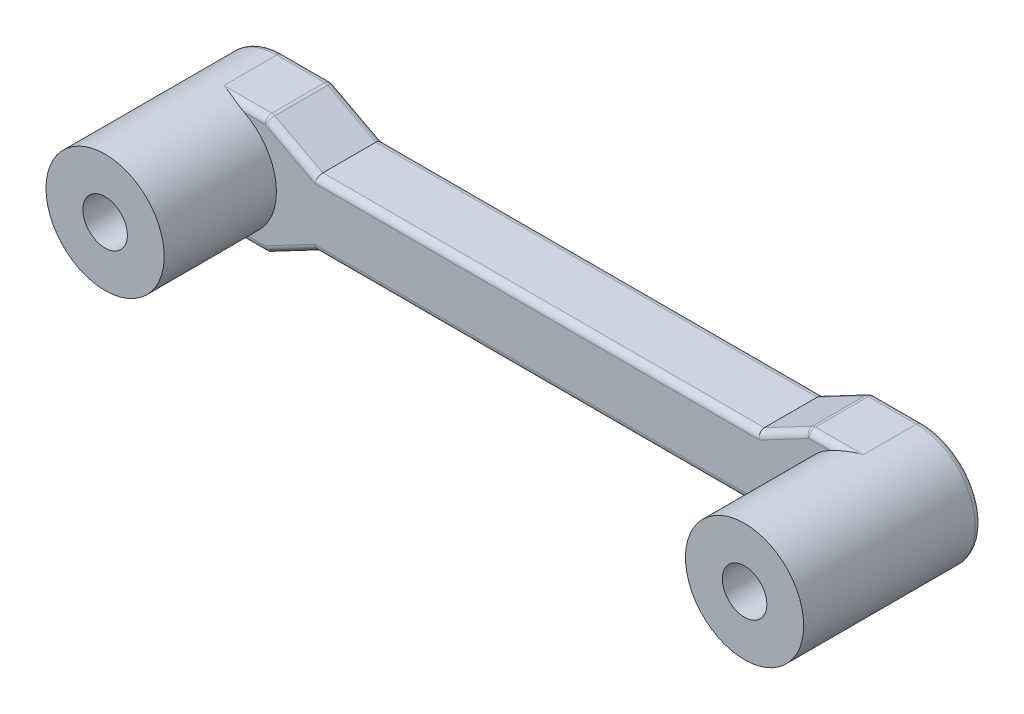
ISO-10303-21;
HEADER;
FILE_DESCRIPTION(('STEP AP214'),'2;1');
FILE_NAME('part.step','',(''),(''),'','','');
FILE_SCHEMA(('AUTOMOTIVE_DESIGN { 1 0 10303 214 1 1 1 1 }'));
ENDSEC;
DATA;
#1=APPLICATION_CONTEXT('core data for automotive mechanical design processes');
#2=APPLICATION_PROTOCOL_DEFINITION('international standard','automotive_design',2000,#1);
#3=PRODUCT_CONTEXT('',#1,'mechanical');
#4=PRODUCT('Part','Part','',(#3));
#5=PRODUCT_RELATED_PRODUCT_CATEGORY('part','',(#4));
#6=PRODUCT_DEFINITION_FORMATION('','',#4);
#7=PRODUCT_DEFINITION_CONTEXT('part definition',#1,'design');
#8=PRODUCT_DEFINITION('design','',#6,#7);
#9=PRODUCT_DEFINITION_SHAPE('','',#8);
#10=(LENGTH_UNIT() NAMED_UNIT(*) SI_UNIT(.MILLI.,.METRE.));
#11=(NAMED_UNIT(*) PLANE_ANGLE_UNIT() SI_UNIT($,.RADIAN.));
#12=(NAMED_UNIT(*) SI_UNIT($,.STERADIAN.) SOLID_ANGLE_UNIT());
#13=UNCERTAINTY_MEASURE_WITH_UNIT(LENGTH_MEASURE(1.E-05),#10,'distance_accuracy_value','');
#14=(GEOMETRIC_REPRESENTATION_CONTEXT(3) GLOBAL_UNCERTAINTY_ASSIGNED_CONTEXT((#13)) GLOBAL_UNIT_ASSIGNED_CONTEXT((#10,
#11,#12)) REPRESENTATION_CONTEXT('',''));
#15=CARTESIAN_POINT('',(0.,0.,0.));
#16=DIRECTION('',(0.,0.,1.));
#17=DIRECTION('',(1.,0.,0.));
#18=AXIS2_PLACEMENT_3D('',#15,#16,#17);
#19=CARTESIAN_POINT('',(-24.60625,0.,5.08));
#20=DIRECTION('',(0.,0.,1.));
#21=DIRECTION('',(1.,0.,0.));
#22=AXIS2_PLACEMENT_3D('',#19,#20,#21);
#23=PLANE('',#22);
#24=CARTESIAN_POINT('',(24.60625,0.,5.08));
#25=DIRECTION('',(0.,0.,1.));
#26=DIRECTION('',(1.,0.,0.));
#27=AXIS2_PLACEMENT_3D('',#24,#25,#26);
#28=CIRCLE('',#27,4.548);
#29=CARTESIAN_POINT('',(22.5175413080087,4.04000000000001,5.08000000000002));
#30=VERTEX_POINT('',#29);
#31=CARTESIAN_POINT('',(22.5175413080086,-4.03999999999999,5.08));
#32=VERTEX_POINT('',#31);
#33=EDGE_CURVE('E227',#30,#32,#28,.T.);
#34=ORIENTED_EDGE('',*,*,#33,.F.);
#35=DIRECTION('',(-1.,0.,0.));
#36=VECTOR('',#35,1.);
#37=CARTESIAN_POINT('',(20.79625,4.04000000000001,5.08));
#38=LINE('',#37,#36);
#39=CARTESIAN_POINT('',(20.9219238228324,4.04000000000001,5.08));
#40=VERTEX_POINT('',#39);
#41=EDGE_CURVE('E213',#30,#40,#38,.T.);
#42=ORIENTED_EDGE('',*,*,#41,.T.);
#43=DIRECTION('',(0.884656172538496,0.466243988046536,0.));
#44=VECTOR('',#43,1.);
#45=CARTESIAN_POINT('',(-16.3755393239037,-15.6170356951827,5.08));
#46=LINE('',#45,#44);
#47=CARTESIAN_POINT('',(17.1119238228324,2.032,5.08));
#48=VERTEX_POINT('',#47);
#49=EDGE_CURVE('E224',#40,#48,#46,.F.);
#50=ORIENTED_EDGE('',*,*,#49,.T.);
#51=DIRECTION('',(1.,0.,0.));
#52=VECTOR('',#51,1.);
#53=CARTESIAN_POINT('',(-24.60625,2.032,5.08));
#54=LINE('',#53,#52);
#55=CARTESIAN_POINT('',(-17.1119238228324,2.032,5.08));
#56=VERTEX_POINT('',#55);
#57=EDGE_CURVE('E300',#48,#56,#54,.F.);
#58=ORIENTED_EDGE('',*,*,#57,.T.);
#59=DIRECTION('',(0.884656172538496,-0.466243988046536,0.));
#60=VECTOR('',#59,1.);
#61=CARTESIAN_POINT('',(-22.1389773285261,4.68142872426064,5.08));
#62=LINE('',#61,#60);
#63=CARTESIAN_POINT('',(-20.9219238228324,4.04,5.08));
#64=VERTEX_POINT('',#63);
#65=EDGE_CURVE('E298',#56,#64,#62,.F.);
#66=ORIENTED_EDGE('',*,*,#65,.T.);
#67=DIRECTION('',(-1.,0.,0.));
#68=VECTOR('',#67,1.);
#69=CARTESIAN_POINT('',(-24.60625,4.04,5.08));
#70=LINE('',#69,#68);
#71=CARTESIAN_POINT('',(-22.5175413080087,4.04,5.08));
#72=VERTEX_POINT('',#71);
#73=EDGE_CURVE('E295',#64,#72,#70,.T.);
#74=ORIENTED_EDGE('',*,*,#73,.T.);
#75=CARTESIAN_POINT('',(-24.60625,0.,5.08));
#76=DIRECTION('',(0.,0.,1.));
#77=DIRECTION('',(1.,0.,0.));
#78=AXIS2_PLACEMENT_3D('',#75,#76,#77);
#79=CIRCLE('',#78,4.548);
#80=CARTESIAN_POINT('',(-22.5175413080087,-4.04,5.08));
#81=VERTEX_POINT('',#80);
#82=EDGE_CURVE('E62',#72,#81,#79,.F.);
#83=ORIENTED_EDGE('',*,*,#82,.T.);
#84=DIRECTION('',(1.,0.,0.));
#85=VECTOR('',#84,1.);
#86=CARTESIAN_POINT('',(-20.79625,-4.04,5.08));
#87=LINE('',#86,#85);
#88=CARTESIAN_POINT('',(-20.9219238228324,-4.04,5.08));
#89=VERTEX_POINT('',#88);
#90=EDGE_CURVE('E302',#81,#89,#87,.T.);
#91=ORIENTED_EDGE('',*,*,#90,.T.);
#92=DIRECTION('',(-0.884656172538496,-0.466243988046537,0.));
#93=VECTOR('',#92,1.);
#94=CARTESIAN_POINT('',(-22.1389773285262,-4.68142872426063,5.08));
#95=LINE('',#94,#93);
#96=CARTESIAN_POINT('',(-17.1119238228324,-2.032,5.08));
#97=VERTEX_POINT('',#96);
#98=EDGE_CURVE('E304',#89,#97,#95,.F.);
#99=ORIENTED_EDGE('',*,*,#98,.T.);
#100=DIRECTION('',(-1.,0.,0.));
#101=VECTOR('',#100,1.);
#102=CARTESIAN_POINT('',(-24.60625,-2.032,5.08));
#103=LINE('',#102,#101);
#104=CARTESIAN_POINT('',(17.1119238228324,-2.032,5.08));
#105=VERTEX_POINT('',#104);
#106=EDGE_CURVE('E306',#97,#105,#103,.F.);
#107=ORIENTED_EDGE('',*,*,#106,.T.);
#108=DIRECTION('',(-0.884656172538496,0.466243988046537,0.));
#109=VECTOR('',#108,1.);
#110=CARTESIAN_POINT('',(-16.3755393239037,15.6170356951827,5.08));
#111=LINE('',#110,#109);
#112=CARTESIAN_POINT('',(20.9219238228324,-4.03999999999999,5.08));
#113=VERTEX_POINT('',#112);
#114=EDGE_CURVE('E308',#105,#113,#111,.F.);
#115=ORIENTED_EDGE('',*,*,#114,.T.);
#116=DIRECTION('',(1.,0.,0.));
#117=VECTOR('',#116,1.);
#118=CARTESIAN_POINT('',(24.60625,-4.03999999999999,5.08));
#119=LINE('',#118,#117);
#120=EDGE_CURVE('E223',#113,#32,#119,.T.);
#121=ORIENTED_EDGE('',*,*,#120,.T.);
#122=EDGE_LOOP('',(#34,#42,#50,#58,#66,#74,#83,#91,#99,#107,#115,#121));
#123=FACE_BOUND('',#122,.T.);
#124=ADVANCED_FACE('F33',(#123),#23,.T.);
#125=CARTESIAN_POINT('',(-24.60625,-4.04,4.572));
#126=DIRECTION('',(-1.,0.,0.));
#127=DIRECTION('',(0.,-1.,0.));
#128=AXIS2_PLACEMENT_3D('',#125,#126,#127);
#129=CYLINDRICAL_SURFACE('',#128,0.508);
#130=ORIENTED_EDGE('',*,*,#90,.F.);
#131=CARTESIAN_POINT('',(-21.7410658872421,-3.532,4.572));
#132=CARTESIAN_POINT('',(-21.7410251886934,-3.53196093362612,4.59305381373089));
#133=CARTESIAN_POINT('',(-21.742675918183,-3.53330629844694,4.61404471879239));
#134=CARTESIAN_POINT('',(-21.7489989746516,-3.53842445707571,4.65505282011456));
#135=CARTESIAN_POINT('',(-21.753640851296,-3.54217278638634,4.6750776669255));
#136=CARTESIAN_POINT('',(-21.765578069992,-3.55175183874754,4.71369024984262));
#137=CARTESIAN_POINT('',(-21.7728647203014,-3.55757573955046,4.73228245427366));
#138=CARTESIAN_POINT('',(-21.7896501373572,-3.57088018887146,4.76783534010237));
#139=CARTESIAN_POINT('',(-21.7991545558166,-3.57836496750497,4.7847916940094));
#140=CARTESIAN_POINT('',(-21.8246397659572,-3.59823712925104,4.82417580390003));
#141=CARTESIAN_POINT('',(-21.8416068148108,-3.6113119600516,4.84561577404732));
#142=CARTESIAN_POINT('',(-21.8782141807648,-3.63904619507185,4.88485708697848));
#143=CARTESIAN_POINT('',(-21.8978598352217,-3.65370875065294,4.9026509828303));
#144=CARTESIAN_POINT('',(-21.9508223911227,-3.69250642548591,4.94418405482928));
#145=CARTESIAN_POINT('',(-21.9855448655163,-3.71727358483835,4.96552396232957));
#146=CARTESIAN_POINT('',(-22.0578970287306,-3.76724740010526,5.00167755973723));
#147=CARTESIAN_POINT('',(-22.0955327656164,-3.79245488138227,5.01647722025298));
#148=CARTESIAN_POINT('',(-22.1680435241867,-3.83941254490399,5.03935880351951));
#149=CARTESIAN_POINT('',(-22.202704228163,-3.86121310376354,5.04803557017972));
#150=CARTESIAN_POINT('',(-22.2731074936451,-3.90415875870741,5.06202091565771));
#151=CARTESIAN_POINT('',(-22.3088508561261,-3.92530334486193,5.06732693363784));
#152=CARTESIAN_POINT('',(-22.4173719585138,-3.98748738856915,5.07904606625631));
#153=CARTESIAN_POINT('',(-22.4913586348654,-4.02722379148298,5.08123764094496));
#154=CARTESIAN_POINT('',(-22.6359930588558,-4.09981801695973,5.07767642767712));
#155=CARTESIAN_POINT('',(-22.7065212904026,-4.13296079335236,5.07245874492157));
#156=CARTESIAN_POINT('',(-22.8487292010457,-4.1954089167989,5.05671559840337));
#157=CARTESIAN_POINT('',(-22.9204098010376,-4.22471100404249,5.04618566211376));
#158=CARTESIAN_POINT('',(-23.0646369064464,-4.279450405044,5.02103863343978));
#159=CARTESIAN_POINT('',(-23.1371846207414,-4.30488141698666,5.00641498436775));
#160=CARTESIAN_POINT('',(-23.2828361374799,-4.35186599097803,4.97401697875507));
#161=CARTESIAN_POINT('',(-23.3559400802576,-4.37341853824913,4.95624180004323));
#162=CARTESIAN_POINT('',(-23.5255422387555,-4.41885866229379,4.91232072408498));
#163=CARTESIAN_POINT('',(-23.6221872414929,-4.44135879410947,4.88529789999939));
#164=CARTESIAN_POINT('',(-23.8159152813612,-4.4798927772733,4.82839657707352));
#165=CARTESIAN_POINT('',(-23.9129984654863,-4.49592426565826,4.79851703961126));
#166=CARTESIAN_POINT('',(-24.2042746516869,-4.53442520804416,4.70630755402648));
#167=CARTESIAN_POINT('',(-24.3990012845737,-4.54743526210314,4.64126415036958));
#168=CARTESIAN_POINT('',(-24.5977219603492,-4.54799399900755,4.57485015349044));
#169=CARTESIAN_POINT('',(-24.6019860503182,-4.54799999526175,4.57342504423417));
#170=CARTESIAN_POINT('',(-24.60625,-4.548,4.572));
#171=B_SPLINE_CURVE_WITH_KNOTS('',3,(#131,#132,#133,#134,#135,#136,#137,#138,#139,#140,#141,
#142,#143,#144,#145,#146,#147,#148,#149,#150,#151,#152,#153,#154,#155,#156,#157,#158,#159,#160,
#161,#162,#163,#164,#165,#166,#167,#168,#169,#170),.UNSPECIFIED.,.F.,.F.,(4,2,2,2,2,2,2,2,2,2,2,
2,2,2,2,2,2,2,2,4),(0.,0.0629542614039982,0.125277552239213,0.187397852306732,0.249678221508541,
0.340087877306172,0.430680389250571,0.572953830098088,0.715530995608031,0.840916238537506,
0.966396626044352,1.21765560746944,1.45166391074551,1.68586956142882,1.92045249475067,
2.15509671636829,2.46332800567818,2.77167178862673,3.38674014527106,3.40022792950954),.UNSPECIFIED.);
#172=CARTESIAN_POINT('',(-24.60625,-4.548,4.572));
#173=VERTEX_POINT('',#172);
#174=EDGE_CURVE('E603',#81,#173,#171,.T.);
#175=ORIENTED_EDGE('',*,*,#174,.T.);
#176=DIRECTION('',(1.,0.,0.));
#177=VECTOR('',#176,1.);
#178=CARTESIAN_POINT('',(-24.60625,-4.548,4.572));
#179=LINE('',#178,#177);
#180=CARTESIAN_POINT('',(-20.79625,-4.548,4.572));
#181=VERTEX_POINT('',#180);
#182=EDGE_CURVE('E290',#181,#173,#179,.F.);
#183=ORIENTED_EDGE('',*,*,#182,.F.);
#184=CARTESIAN_POINT('',(-20.9219238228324,-4.04,4.572));
#185=DIRECTION('',(-0.970735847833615,-0.240149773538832,0.));
#186=DIRECTION('',(0.240149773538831,-0.970735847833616,0.));
#187=AXIS2_PLACEMENT_3D('',#184,#185,#186);
#188=ELLIPSE('',#187,0.523314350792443,0.508);
#189=EDGE_CURVE('E426',#89,#181,#188,.F.);
#190=ORIENTED_EDGE('',*,*,#189,.F.);
#191=EDGE_LOOP('',(#130,#175,#183,#190));
#192=FACE_BOUND('',#191,.T.);
#193=ADVANCED_FACE('F35',(#192),#129,.T.);
#194=CARTESIAN_POINT('',(-24.60625,4.04,4.572));
#195=DIRECTION('',(1.,0.,0.));
#196=DIRECTION('',(0.,1.,0.));
#197=AXIS2_PLACEMENT_3D('',#194,#195,#196);
#198=CYLINDRICAL_SURFACE('',#197,0.508);
#199=DIRECTION('',(-1.,0.,0.));
#200=VECTOR('',#199,1.);
#201=CARTESIAN_POINT('',(-20.79625,4.548,4.572));
#202=LINE('',#201,#200);
#203=CARTESIAN_POINT('',(-24.60625,4.548,4.572));
#204=VERTEX_POINT('',#203);
#205=CARTESIAN_POINT('',(-20.9219238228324,4.548,4.572));
#206=VERTEX_POINT('',#205);
#207=EDGE_CURVE('E284',#204,#206,#202,.F.);
#208=ORIENTED_EDGE('',*,*,#207,.F.);
#209=CARTESIAN_POINT('',(-21.7410658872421,3.532,4.572));
#210=CARTESIAN_POINT('',(-21.7410251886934,3.53196093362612,4.59305381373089));
#211=CARTESIAN_POINT('',(-21.742675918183,3.53330629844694,4.61404471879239));
#212=CARTESIAN_POINT('',(-21.7489989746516,3.53842445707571,4.65505282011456));
#213=CARTESIAN_POINT('',(-21.753640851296,3.54217278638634,4.6750776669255));
#214=CARTESIAN_POINT('',(-21.765578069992,3.55175183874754,4.71369024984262));
#215=CARTESIAN_POINT('',(-21.7728647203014,3.55757573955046,4.73228245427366));
#216=CARTESIAN_POINT('',(-21.7896501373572,3.57088018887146,4.76783534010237));
#217=CARTESIAN_POINT('',(-21.7991545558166,3.57836496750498,4.7847916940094));
#218=CARTESIAN_POINT('',(-21.8246397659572,3.59823712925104,4.82417580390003));
#219=CARTESIAN_POINT('',(-21.8416068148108,3.61131196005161,4.84561577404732));
#220=CARTESIAN_POINT('',(-21.8782141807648,3.63904619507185,4.88485708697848));
#221=CARTESIAN_POINT('',(-21.8978598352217,3.65370875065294,4.9026509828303));
#222=CARTESIAN_POINT('',(-21.9508223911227,3.69250642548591,4.94418405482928));
#223=CARTESIAN_POINT('',(-21.9855448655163,3.71727358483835,4.96552396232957));
#224=CARTESIAN_POINT('',(-22.0578970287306,3.76724740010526,5.00167755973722));
#225=CARTESIAN_POINT('',(-22.0955327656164,3.79245488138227,5.01647722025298));
#226=CARTESIAN_POINT('',(-22.1680435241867,3.83941254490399,5.03935880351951));
#227=CARTESIAN_POINT('',(-22.202704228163,3.86121310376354,5.04803557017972));
#228=CARTESIAN_POINT('',(-22.2731074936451,3.90415875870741,5.06202091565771));
#229=CARTESIAN_POINT('',(-22.3088508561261,3.92530334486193,5.06732693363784));
#230=CARTESIAN_POINT('',(-22.4173719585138,3.98748738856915,5.07904606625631));
#231=CARTESIAN_POINT('',(-22.4913586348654,4.02722379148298,5.08123764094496));
#232=CARTESIAN_POINT('',(-22.6359930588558,4.09981801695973,5.07767642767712));
#233=CARTESIAN_POINT('',(-22.7065212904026,4.13296079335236,5.07245874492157));
#234=CARTESIAN_POINT('',(-22.8487292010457,4.1954089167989,5.05671559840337));
#235=CARTESIAN_POINT('',(-22.9204098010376,4.22471100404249,5.04618566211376));
#236=CARTESIAN_POINT('',(-23.0646369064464,4.279450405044,5.02103863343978));
#237=CARTESIAN_POINT('',(-23.1371846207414,4.30488141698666,5.00641498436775));
#238=CARTESIAN_POINT('',(-23.2828361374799,4.35186599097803,4.97401697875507));
#239=CARTESIAN_POINT('',(-23.3559400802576,4.37341853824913,4.95624180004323));
#240=CARTESIAN_POINT('',(-23.5255422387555,4.41885866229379,4.91232072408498));
#241=CARTESIAN_POINT('',(-23.6221872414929,4.44135879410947,4.88529789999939));
#242=CARTESIAN_POINT('',(-23.8159152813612,4.4798927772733,4.82839657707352));
#243=CARTESIAN_POINT('',(-23.9129984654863,4.49592426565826,4.79851703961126));
#244=CARTESIAN_POINT('',(-24.2042746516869,4.53442520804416,4.70630755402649));
#245=CARTESIAN_POINT('',(-24.3990012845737,4.54743526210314,4.64126415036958));
#246=CARTESIAN_POINT('',(-24.5977219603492,4.54799399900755,4.57485015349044));
#247=CARTESIAN_POINT('',(-24.6019860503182,4.54799999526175,4.57342504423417));
#248=CARTESIAN_POINT('',(-24.60625,4.548,4.572));
#249=B_SPLINE_CURVE_WITH_KNOTS('',3,(#209,#210,#211,#212,#213,#214,#215,#216,#217,#218,#219,
#220,#221,#222,#223,#224,#225,#226,#227,#228,#229,#230,#231,#232,#233,#234,#235,#236,#237,#238,
#239,#240,#241,#242,#243,#244,#245,#246,#247,#248),.UNSPECIFIED.,.F.,.F.,(4,2,2,2,2,2,2,2,2,2,2,
2,2,2,2,2,2,2,2,4),(0.,0.0629542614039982,0.125277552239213,0.187397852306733,0.249678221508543,
0.340087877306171,0.43068038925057,0.572953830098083,0.71553099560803,0.840916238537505,
0.966396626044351,1.21765560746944,1.4516639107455,1.68586956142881,1.92045249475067,
2.15509671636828,2.46332800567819,2.77167178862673,3.38674014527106,3.40022792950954),.UNSPECIFIED.);
#250=EDGE_CURVE('E47',#204,#72,#249,.F.);
#251=ORIENTED_EDGE('',*,*,#250,.T.);
#252=ORIENTED_EDGE('',*,*,#73,.F.);
#253=CARTESIAN_POINT('',(-20.9219238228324,4.04,4.572));
#254=DIRECTION('',(1.,0.,0.));
#255=DIRECTION('',(0.,0.,-1.));
#256=AXIS2_PLACEMENT_3D('',#253,#254,#255);
#257=CIRCLE('',#256,0.508);
#258=EDGE_CURVE('E417',#206,#64,#257,.T.);
#259=ORIENTED_EDGE('',*,*,#258,.F.);
#260=EDGE_LOOP('',(#208,#251,#252,#259));
#261=FACE_BOUND('',#260,.T.);
#262=ADVANCED_FACE('F437',(#261),#198,.T.);
#263=CARTESIAN_POINT('',(-24.60625,0.,0.));
#264=DIRECTION('',(0.,0.,1.));
#265=DIRECTION('',(1.,0.,0.));
#266=AXIS2_PLACEMENT_3D('',#263,#264,#265);
#267=PLANE('',#266);
#268=CARTESIAN_POINT('',(-24.60625,0.,0.));
#269=DIRECTION('',(0.,0.,1.));
#270=DIRECTION('',(1.,0.,0.));
#271=AXIS2_PLACEMENT_3D('',#268,#269,#270);
#272=CIRCLE('',#271,1.7145);
#273=CARTESIAN_POINT('',(-22.89175,0.,0.));
#274=VERTEX_POINT('',#273);
#275=EDGE_CURVE('E352',#274,#274,#272,.T.);
#276=ORIENTED_EDGE('',*,*,#275,.T.);
#277=EDGE_LOOP('',(#276));
#278=FACE_BOUND('',#277,.T.);
#279=DIRECTION('',(-0.884656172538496,0.466243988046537,0.));
#280=VECTOR('',#279,1.);
#281=CARTESIAN_POINT('',(17.2231019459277,-2.09059466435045,0.));
#282=LINE('',#281,#280);
#283=CARTESIAN_POINT('',(20.9219238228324,-4.03999999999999,0.));
#284=VERTEX_POINT('',#283);
#285=CARTESIAN_POINT('',(17.1119238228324,-2.032,0.));
#286=VERTEX_POINT('',#285);
#287=EDGE_CURVE('E275',#284,#286,#282,.T.);
#288=ORIENTED_EDGE('',*,*,#287,.T.);
#289=DIRECTION('',(-1.,0.,0.));
#290=VECTOR('',#289,1.);
#291=CARTESIAN_POINT('',(-16.98625,-2.032,0.));
#292=LINE('',#291,#290);
#293=CARTESIAN_POINT('',(-17.1119238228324,-2.032,0.));
#294=VERTEX_POINT('',#293);
#295=EDGE_CURVE('E281',#286,#294,#292,.T.);
#296=ORIENTED_EDGE('',*,*,#295,.T.);
#297=DIRECTION('',(-0.884656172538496,-0.466243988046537,0.));
#298=VECTOR('',#297,1.);
#299=CARTESIAN_POINT('',(-21.0331019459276,-4.09859466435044,0.));
#300=LINE('',#299,#298);
#301=CARTESIAN_POINT('',(-20.9219238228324,-4.04,0.));
#302=VERTEX_POINT('',#301);
#303=EDGE_CURVE('E279',#294,#302,#300,.T.);
#304=ORIENTED_EDGE('',*,*,#303,.T.);
#305=DIRECTION('',(1.,0.,0.));
#306=VECTOR('',#305,1.);
#307=CARTESIAN_POINT('',(-24.60625,-4.04,0.));
#308=LINE('',#307,#306);
#309=CARTESIAN_POINT('',(-24.60625,-4.04,0.));
#310=VERTEX_POINT('',#309);
#311=EDGE_CURVE('E277',#302,#310,#308,.F.);
#312=ORIENTED_EDGE('',*,*,#311,.T.);
#313=CARTESIAN_POINT('',(-24.60625,0.,0.));
#314=DIRECTION('',(0.,0.,1.));
#315=DIRECTION('',(1.,0.,0.));
#316=AXIS2_PLACEMENT_3D('',#313,#314,#315);
#317=CIRCLE('',#316,4.04);
#318=CARTESIAN_POINT('',(-24.60625,4.04,0.));
#319=VERTEX_POINT('',#318);
#320=EDGE_CURVE('E273',#310,#319,#317,.F.);
#321=ORIENTED_EDGE('',*,*,#320,.T.);
#322=DIRECTION('',(-1.,0.,0.));
#323=VECTOR('',#322,1.);
#324=CARTESIAN_POINT('',(-24.60625,4.04,0.));
#325=LINE('',#324,#323);
#326=CARTESIAN_POINT('',(-20.9219238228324,4.04,0.));
#327=VERTEX_POINT('',#326);
#328=EDGE_CURVE('E266',#319,#327,#325,.F.);
#329=ORIENTED_EDGE('',*,*,#328,.T.);
#330=DIRECTION('',(0.884656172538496,-0.466243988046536,0.));
#331=VECTOR('',#330,1.);
#332=CARTESIAN_POINT('',(-17.2231019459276,2.09059466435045,0.));
#333=LINE('',#332,#331);
#334=CARTESIAN_POINT('',(-17.1119238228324,2.032,0.));
#335=VERTEX_POINT('',#334);
#336=EDGE_CURVE('E258',#327,#335,#333,.T.);
#337=ORIENTED_EDGE('',*,*,#336,.T.);
#338=DIRECTION('',(1.,0.,0.));
#339=VECTOR('',#338,1.);
#340=CARTESIAN_POINT('',(16.98625,2.032,0.));
#341=LINE('',#340,#339);
#342=CARTESIAN_POINT('',(17.1119238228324,2.032,0.));
#343=VERTEX_POINT('',#342);
#344=EDGE_CURVE('E260',#335,#343,#341,.T.);
#345=ORIENTED_EDGE('',*,*,#344,.T.);
#346=DIRECTION('',(0.884656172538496,0.466243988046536,0.));
#347=VECTOR('',#346,1.);
#348=CARTESIAN_POINT('',(21.0331019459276,4.09859466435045,0.));
#349=LINE('',#348,#347);
#350=CARTESIAN_POINT('',(20.9219238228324,4.04000000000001,0.));
#351=VERTEX_POINT('',#350);
#352=EDGE_CURVE('E262',#343,#351,#349,.T.);
#353=ORIENTED_EDGE('',*,*,#352,.T.);
#354=DIRECTION('',(-1.,0.,0.));
#355=VECTOR('',#354,1.);
#356=CARTESIAN_POINT('',(-24.60625,4.04,0.));
#357=LINE('',#356,#355);
#358=CARTESIAN_POINT('',(24.60625,4.04000000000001,0.));
#359=VERTEX_POINT('',#358);
#360=EDGE_CURVE('E264',#351,#359,#357,.F.);
#361=ORIENTED_EDGE('',*,*,#360,.T.);
#362=CARTESIAN_POINT('',(24.60625,0.,0.));
#363=DIRECTION('',(0.,0.,1.));
#364=DIRECTION('',(1.,0.,0.));
#365=AXIS2_PLACEMENT_3D('',#362,#363,#364);
#366=CIRCLE('',#365,4.04);
#367=CARTESIAN_POINT('',(24.60625,-4.03999999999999,0.));
#368=VERTEX_POINT('',#367);
#369=EDGE_CURVE('E268',#359,#368,#366,.F.);
#370=ORIENTED_EDGE('',*,*,#369,.T.);
#371=DIRECTION('',(1.,0.,0.));
#372=VECTOR('',#371,1.);
#373=CARTESIAN_POINT('',(-24.60625,-4.04,0.));
#374=LINE('',#373,#372);
#375=EDGE_CURVE('E270',#368,#284,#374,.F.);
#376=ORIENTED_EDGE('',*,*,#375,.T.);
#377=EDGE_LOOP('',(#288,#296,#304,#312,#321,#329,#337,#345,#353,#361,#370,#376));
#378=FACE_BOUND('',#377,.T.);
#379=CARTESIAN_POINT('',(24.60625,0.,0.));
#380=DIRECTION('',(0.,0.,-1.));
#381=DIRECTION('',(-1.,0.,0.));
#382=AXIS2_PLACEMENT_3D('',#379,#380,#381);
#383=CIRCLE('',#382,1.7145);
#384=CARTESIAN_POINT('',(22.89175,0.,0.));
#385=VERTEX_POINT('',#384);
#386=EDGE_CURVE('E610',#385,#385,#383,.T.);
#387=ORIENTED_EDGE('',*,*,#386,.F.);
#388=EDGE_LOOP('',(#387));
#389=FACE_BOUND('',#388,.T.);
#390=ADVANCED_FACE('F442',(#278,#378,#389),#267,.F.);
#391=CARTESIAN_POINT('',(-24.60625,-4.548,5.08));
#392=DIRECTION('',(0.,1.,0.));
#393=DIRECTION('',(-1.,0.,0.));
#394=AXIS2_PLACEMENT_3D('',#391,#392,#393);
#395=PLANE('',#394);
#396=DIRECTION('',(0.,0.,-1.));
#397=VECTOR('',#396,1.);
#398=CARTESIAN_POINT('',(-24.60625,-4.548,5.08));
#399=LINE('',#398,#397);
#400=CARTESIAN_POINT('',(-24.60625,-4.548,0.508));
#401=VERTEX_POINT('',#400);
#402=EDGE_CURVE('E244',#173,#401,#399,.T.);
#403=ORIENTED_EDGE('',*,*,#402,.T.);
#404=DIRECTION('',(1.,0.,0.));
#405=VECTOR('',#404,1.);
#406=CARTESIAN_POINT('',(-24.60625,-4.548,0.508));
#407=LINE('',#406,#405);
#408=CARTESIAN_POINT('',(-20.79625,-4.548,0.508));
#409=VERTEX_POINT('',#408);
#410=EDGE_CURVE('E293',#401,#409,#407,.T.);
#411=ORIENTED_EDGE('',*,*,#410,.T.);
#412=DIRECTION('',(0.,0.,-1.));
#413=VECTOR('',#412,1.);
#414=CARTESIAN_POINT('',(-20.79625,-4.548,5.08));
#415=LINE('',#414,#413);
#416=EDGE_CURVE('E623',#181,#409,#415,.T.);
#417=ORIENTED_EDGE('',*,*,#416,.F.);
#418=ORIENTED_EDGE('',*,*,#182,.T.);
#419=EDGE_LOOP('',(#403,#411,#417,#418));
#420=FACE_BOUND('',#419,.T.);
#421=ADVANCED_FACE('F471',(#420),#395,.F.);
#422=DIRECTION('',(0.,0.,-1.));
#423=VECTOR('',#422,1.);
#424=CARTESIAN_POINT('',(20.79625,-4.548,5.08));
#425=LINE('',#424,#423);
#426=CARTESIAN_POINT('',(20.79625,-4.548,4.572));
#427=VERTEX_POINT('',#426);
#428=CARTESIAN_POINT('',(20.79625,-4.548,0.508));
#429=VERTEX_POINT('',#428);
#430=EDGE_CURVE('E620',#427,#429,#425,.T.);
#431=ORIENTED_EDGE('',*,*,#430,.T.);
#432=DIRECTION('',(1.,0.,0.));
#433=VECTOR('',#432,1.);
#434=CARTESIAN_POINT('',(-24.60625,-4.548,0.508));
#435=LINE('',#434,#433);
#436=CARTESIAN_POINT('',(24.60625,-4.54799999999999,0.508));
#437=VERTEX_POINT('',#436);
#438=EDGE_CURVE('E255',#429,#437,#435,.T.);
#439=ORIENTED_EDGE('',*,*,#438,.T.);
#440=DIRECTION('',(0.,0.,-1.));
#441=VECTOR('',#440,1.);
#442=CARTESIAN_POINT('',(24.60625,-4.54799999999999,5.08));
#443=LINE('',#442,#441);
#444=CARTESIAN_POINT('',(24.60625,-4.54799999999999,4.572));
#445=VERTEX_POINT('',#444);
#446=EDGE_CURVE('E241',#445,#437,#443,.T.);
#447=ORIENTED_EDGE('',*,*,#446,.F.);
#448=DIRECTION('',(1.,0.,0.));
#449=VECTOR('',#448,1.);
#450=CARTESIAN_POINT('',(20.79625,-4.54799999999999,4.572));
#451=LINE('',#450,#449);
#452=EDGE_CURVE('E253',#445,#427,#451,.F.);
#453=ORIENTED_EDGE('',*,*,#452,.T.);
#454=EDGE_LOOP('',(#431,#439,#447,#453));
#455=FACE_BOUND('',#454,.T.);
#456=ADVANCED_FACE('F477',(#455),#395,.F.);
#457=CARTESIAN_POINT('',(-24.60625,4.548,5.08));
#458=DIRECTION('',(0.,-1.,0.));
#459=DIRECTION('',(1.,0.,0.));
#460=AXIS2_PLACEMENT_3D('',#457,#458,#459);
#461=PLANE('',#460);
#462=DIRECTION('',(0.,0.,-1.));
#463=VECTOR('',#462,1.);
#464=CARTESIAN_POINT('',(-20.9219238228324,4.548,0.));
#465=LINE('',#464,#463);
#466=CARTESIAN_POINT('',(-20.9219238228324,4.548,0.508));
#467=VERTEX_POINT('',#466);
#468=EDGE_CURVE('E286',#206,#467,#465,.T.);
#469=ORIENTED_EDGE('',*,*,#468,.T.);
#470=DIRECTION('',(-1.,0.,0.));
#471=VECTOR('',#470,1.);
#472=CARTESIAN_POINT('',(-24.60625,4.548,0.508));
#473=LINE('',#472,#471);
#474=CARTESIAN_POINT('',(-24.60625,4.548,0.508));
#475=VERTEX_POINT('',#474);
#476=EDGE_CURVE('E288',#467,#475,#473,.T.);
#477=ORIENTED_EDGE('',*,*,#476,.T.);
#478=DIRECTION('',(0.,0.,-1.));
#479=VECTOR('',#478,1.);
#480=CARTESIAN_POINT('',(-24.60625,4.548,5.08));
#481=LINE('',#480,#479);
#482=EDGE_CURVE('E242',#204,#475,#481,.T.);
#483=ORIENTED_EDGE('',*,*,#482,.F.);
#484=ORIENTED_EDGE('',*,*,#207,.T.);
#485=EDGE_LOOP('',(#469,#477,#483,#484));
#486=FACE_BOUND('',#485,.T.);
#487=ADVANCED_FACE('F473',(#486),#461,.F.);
#488=DIRECTION('',(0.,0.,-1.));
#489=VECTOR('',#488,1.);
#490=CARTESIAN_POINT('',(24.60625,4.54800000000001,5.08));
#491=LINE('',#490,#489);
#492=CARTESIAN_POINT('',(24.60625,4.54800000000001,4.572));
#493=VERTEX_POINT('',#492);
#494=CARTESIAN_POINT('',(24.60625,4.54800000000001,0.508));
#495=VERTEX_POINT('',#494);
#496=EDGE_CURVE('E236',#493,#495,#491,.T.);
#497=ORIENTED_EDGE('',*,*,#496,.T.);
#498=DIRECTION('',(-1.,0.,0.));
#499=VECTOR('',#498,1.);
#500=CARTESIAN_POINT('',(-24.60625,4.548,0.508));
#501=LINE('',#500,#499);
#502=CARTESIAN_POINT('',(20.9219238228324,4.54800000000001,0.508));
#503=VERTEX_POINT('',#502);
#504=EDGE_CURVE('E323',#495,#503,#501,.T.);
#505=ORIENTED_EDGE('',*,*,#504,.T.);
#506=DIRECTION('',(0.,0.,-1.));
#507=VECTOR('',#506,1.);
#508=CARTESIAN_POINT('',(20.9219238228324,4.54800000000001,5.08));
#509=LINE('',#508,#507);
#510=CARTESIAN_POINT('',(20.9219238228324,4.54800000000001,4.572));
#511=VERTEX_POINT('',#510);
#512=EDGE_CURVE('E321',#503,#511,#509,.F.);
#513=ORIENTED_EDGE('',*,*,#512,.T.);
#514=DIRECTION('',(-1.,0.,0.));
#515=VECTOR('',#514,1.);
#516=CARTESIAN_POINT('',(24.60625,4.54800000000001,4.572));
#517=LINE('',#516,#515);
#518=EDGE_CURVE('E319',#511,#493,#517,.F.);
#519=ORIENTED_EDGE('',*,*,#518,.T.);
#520=EDGE_LOOP('',(#497,#505,#513,#519));
#521=FACE_BOUND('',#520,.T.);
#522=ADVANCED_FACE('F476',(#521),#461,.F.);
#523=CARTESIAN_POINT('',(-24.60625,0.,5.08));
#524=DIRECTION('',(0.,0.,-1.));
#525=DIRECTION('',(-1.,0.,0.));
#526=AXIS2_PLACEMENT_3D('',#523,#524,#525);
#527=CYLINDRICAL_SURFACE('',#526,4.548);
#528=ORIENTED_EDGE('',*,*,#402,.F.);
#529=ORIENTED_EDGE('',*,*,#174,.F.);
#530=ORIENTED_EDGE('',*,*,#82,.F.);
#531=ORIENTED_EDGE('',*,*,#250,.F.);
#532=ORIENTED_EDGE('',*,*,#482,.T.);
#533=CARTESIAN_POINT('',(-24.60625,0.,0.508));
#534=DIRECTION('',(0.,0.,1.));
#535=DIRECTION('',(1.,0.,0.));
#536=AXIS2_PLACEMENT_3D('',#533,#534,#535);
#537=CIRCLE('',#536,4.548);
#538=EDGE_CURVE('E312',#475,#401,#537,.T.);
#539=ORIENTED_EDGE('',*,*,#538,.T.);
#540=EDGE_LOOP('',(#528,#529,#530,#531,#532,#539));
#541=FACE_BOUND('',#540,.T.);
#542=CARTESIAN_POINT('',(-24.60625,0.,13.716));
#543=DIRECTION('',(0.,0.,1.));
#544=DIRECTION('',(-1.,0.,0.));
#545=AXIS2_PLACEMENT_3D('',#542,#543,#544);
#546=CIRCLE('',#545,4.548);
#547=CARTESIAN_POINT('',(-29.15425,0.,13.716));
#548=VERTEX_POINT('',#547);
#549=EDGE_CURVE('E599',#548,#548,#546,.T.);
#550=ORIENTED_EDGE('',*,*,#549,.F.);
#551=EDGE_LOOP('',(#550));
#552=FACE_BOUND('',#551,.T.);
#553=ADVANCED_FACE('F481',(#541,#552),#527,.T.);
#554=CARTESIAN_POINT('',(24.60625,0.,5.08));
#555=DIRECTION('',(0.,0.,-1.));
#556=DIRECTION('',(-1.,0.,0.));
#557=AXIS2_PLACEMENT_3D('',#554,#555,#556);
#558=CYLINDRICAL_SURFACE('',#557,4.548);
#559=ORIENTED_EDGE('',*,*,#446,.T.);
#560=CARTESIAN_POINT('',(24.60625,0.,0.508));
#561=DIRECTION('',(0.,0.,1.));
#562=DIRECTION('',(1.,0.,0.));
#563=AXIS2_PLACEMENT_3D('',#560,#561,#562);
#564=CIRCLE('',#563,4.548);
#565=EDGE_CURVE('E238',#437,#495,#564,.T.);
#566=ORIENTED_EDGE('',*,*,#565,.T.);
#567=ORIENTED_EDGE('',*,*,#496,.F.);
#568=CARTESIAN_POINT('',(21.7410658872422,3.53200000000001,4.572));
#569=CARTESIAN_POINT('',(21.7410251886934,3.53196093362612,4.59305381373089));
#570=CARTESIAN_POINT('',(21.742675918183,3.53330629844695,4.61404471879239));
#571=CARTESIAN_POINT('',(21.7489989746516,3.53842445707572,4.65505282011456));
#572=CARTESIAN_POINT('',(21.7536408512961,3.54217278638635,4.6750776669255));
#573=CARTESIAN_POINT('',(21.765578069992,3.55175183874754,4.71369024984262));
#574=CARTESIAN_POINT('',(21.7728647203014,3.55757573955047,4.73228245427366));
#575=CARTESIAN_POINT('',(21.7896501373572,3.57088018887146,4.76783534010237));
#576=CARTESIAN_POINT('',(21.7991545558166,3.57836496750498,4.7847916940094));
#577=CARTESIAN_POINT('',(21.8246397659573,3.59823712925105,4.82417580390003));
#578=CARTESIAN_POINT('',(21.8416068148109,3.61131196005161,4.84561577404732));
#579=CARTESIAN_POINT('',(21.8782141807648,3.63904619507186,4.88485708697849));
#580=CARTESIAN_POINT('',(21.8978598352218,3.65370875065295,4.9026509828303));
#581=CARTESIAN_POINT('',(21.9508223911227,3.69250642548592,4.94418405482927));
#582=CARTESIAN_POINT('',(21.9855448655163,3.71727358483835,4.96552396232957));
#583=CARTESIAN_POINT('',(22.0578970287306,3.76724740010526,5.00167755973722));
#584=CARTESIAN_POINT('',(22.0955327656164,3.79245488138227,5.01647722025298));
#585=CARTESIAN_POINT('',(22.1680435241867,3.83941254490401,5.03935880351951));
#586=CARTESIAN_POINT('',(22.202704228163,3.86121310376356,5.04803557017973));
#587=CARTESIAN_POINT('',(22.2731074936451,3.90415875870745,5.06202091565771));
#588=CARTESIAN_POINT('',(22.3088508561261,3.92530334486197,5.06732693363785));
#589=CARTESIAN_POINT('',(22.4173719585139,3.98748738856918,5.07904606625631));
#590=CARTESIAN_POINT('',(22.4913586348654,4.027223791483,5.08123764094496));
#591=CARTESIAN_POINT('',(22.6359930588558,4.09981801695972,5.07767642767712));
#592=CARTESIAN_POINT('',(22.7065212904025,4.13296079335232,5.07245874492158));
#593=CARTESIAN_POINT('',(22.8487292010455,4.19540891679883,5.05671559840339));
#594=CARTESIAN_POINT('',(22.9204098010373,4.2247110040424,5.04618566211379));
#595=CARTESIAN_POINT('',(23.0646369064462,4.27945040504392,5.02103863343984));
#596=CARTESIAN_POINT('',(23.1371846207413,4.3048814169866,5.00641498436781));
#597=CARTESIAN_POINT('',(23.2828361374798,4.35186599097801,4.97401697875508));
#598=CARTESIAN_POINT('',(23.3559400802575,4.37341853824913,4.95624180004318));
#599=CARTESIAN_POINT('',(23.5255422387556,4.4188586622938,4.91232072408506));
#600=CARTESIAN_POINT('',(23.6221872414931,4.44135879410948,4.88529789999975));
#601=CARTESIAN_POINT('',(23.8159152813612,4.47989277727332,4.82839657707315));
#602=CARTESIAN_POINT('',(23.912998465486,4.49592426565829,4.79851703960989));
#603=CARTESIAN_POINT('',(24.2042746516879,4.53442520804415,4.70630755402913));
#604=CARTESIAN_POINT('',(24.3990012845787,4.54743526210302,4.64126415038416));
#605=CARTESIAN_POINT('',(24.5977219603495,4.54799399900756,4.57485015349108));
#606=CARTESIAN_POINT('',(24.6019860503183,4.54799999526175,4.5734250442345));
#607=CARTESIAN_POINT('',(24.60625,4.54800000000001,4.572));
#608=B_SPLINE_CURVE_WITH_KNOTS('',3,(#568,#569,#570,#571,#572,#573,#574,#575,#576,#577,#578,
#579,#580,#581,#582,#583,#584,#585,#586,#587,#588,#589,#590,#591,#592,#593,#594,#595,#596,#597,
#598,#599,#600,#601,#602,#603,#604,#605,#606,#607),.UNSPECIFIED.,.F.,.F.,(4,2,2,2,2,2,2,2,2,2,2,
2,2,2,2,2,2,2,2,4),(0.,0.062954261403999,0.125277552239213,0.187397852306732,0.249678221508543,
0.340087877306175,0.43068038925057,0.572953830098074,0.715530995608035,0.840916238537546,
0.966396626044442,1.21765560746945,1.45166391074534,1.68586956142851,1.92045249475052,
2.1550967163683,2.46332800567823,2.77167178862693,3.38674014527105,3.40022792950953),.UNSPECIFIED.);
#609=EDGE_CURVE('E11',#493,#30,#608,.F.);
#610=ORIENTED_EDGE('',*,*,#609,.T.);
#611=ORIENTED_EDGE('',*,*,#33,.T.);
#612=CARTESIAN_POINT('',(21.7410658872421,-3.53199999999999,4.572));
#613=CARTESIAN_POINT('',(21.7410251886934,-3.53196093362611,4.59305381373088));
#614=CARTESIAN_POINT('',(21.742675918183,-3.53330629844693,4.61404471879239));
#615=CARTESIAN_POINT('',(21.7489989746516,-3.5384244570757,4.65505282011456));
#616=CARTESIAN_POINT('',(21.753640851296,-3.54217278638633,4.6750776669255));
#617=CARTESIAN_POINT('',(21.765578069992,-3.55175183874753,4.71369024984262));
#618=CARTESIAN_POINT('',(21.7728647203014,-3.55757573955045,4.73228245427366));
#619=CARTESIAN_POINT('',(21.7896501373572,-3.57088018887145,4.76783534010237));
#620=CARTESIAN_POINT('',(21.7991545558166,-3.57836496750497,4.7847916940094));
#621=CARTESIAN_POINT('',(21.8246397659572,-3.59823712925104,4.82417580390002));
#622=CARTESIAN_POINT('',(21.8416068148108,-3.6113119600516,4.84561577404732));
#623=CARTESIAN_POINT('',(21.8782141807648,-3.63904619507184,4.88485708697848));
#624=CARTESIAN_POINT('',(21.8978598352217,-3.65370875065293,4.9026509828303));
#625=CARTESIAN_POINT('',(21.9508223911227,-3.69250642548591,4.94418405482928));
#626=CARTESIAN_POINT('',(21.9855448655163,-3.71727358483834,4.96552396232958));
#627=CARTESIAN_POINT('',(22.0578970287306,-3.76724740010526,5.00167755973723));
#628=CARTESIAN_POINT('',(22.0955327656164,-3.79245488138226,5.01647722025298));
#629=CARTESIAN_POINT('',(22.1680435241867,-3.83941254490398,5.03935880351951));
#630=CARTESIAN_POINT('',(22.2027042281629,-3.86121310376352,5.04803557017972));
#631=CARTESIAN_POINT('',(22.273107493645,-3.90415875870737,5.0620209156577));
#632=CARTESIAN_POINT('',(22.308850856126,-3.92530334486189,5.06732693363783));
#633=CARTESIAN_POINT('',(22.4173719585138,-3.98748738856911,5.07904606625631));
#634=CARTESIAN_POINT('',(22.4913586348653,-4.02722379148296,5.08123764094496));
#635=CARTESIAN_POINT('',(22.6359930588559,-4.09981801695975,5.07767642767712));
#636=CARTESIAN_POINT('',(22.7065212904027,-4.13296079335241,5.07245874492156));
#637=CARTESIAN_POINT('',(22.8487292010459,-4.19540891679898,5.05671559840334));
#638=CARTESIAN_POINT('',(22.9204098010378,-4.22471100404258,5.04618566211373));
#639=CARTESIAN_POINT('',(23.0646369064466,-4.27945040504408,5.02103863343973));
#640=CARTESIAN_POINT('',(23.1371846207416,-4.30488141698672,5.00641498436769));
#641=CARTESIAN_POINT('',(23.28283613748,-4.35186599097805,4.97401697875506));
#642=CARTESIAN_POINT('',(23.3559400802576,-4.37341853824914,4.95624180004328));
#643=CARTESIAN_POINT('',(23.5255422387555,-4.41885866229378,4.9123207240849));
#644=CARTESIAN_POINT('',(23.6221872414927,-4.44135879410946,4.88529789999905));
#645=CARTESIAN_POINT('',(23.8159152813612,-4.47989277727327,4.82839657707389));
#646=CARTESIAN_POINT('',(23.9129984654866,-4.49592426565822,4.79851703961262));
#647=CARTESIAN_POINT('',(24.2042746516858,-4.53442520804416,4.70630755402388));
#648=CARTESIAN_POINT('',(24.3990012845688,-4.54743526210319,4.64126415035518));
#649=CARTESIAN_POINT('',(24.597721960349,-4.54799399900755,4.57485015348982));
#650=CARTESIAN_POINT('',(24.6019860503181,-4.54799999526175,4.57342504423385));
#651=CARTESIAN_POINT('',(24.60625,-4.548,4.572));
#652=B_SPLINE_CURVE_WITH_KNOTS('',3,(#612,#613,#614,#615,#616,#617,#618,#619,#620,#621,#622,
#623,#624,#625,#626,#627,#628,#629,#630,#631,#632,#633,#634,#635,#636,#637,#638,#639,#640,#641,
#642,#643,#644,#645,#646,#647,#648,#649,#650,#651),.UNSPECIFIED.,.F.,.F.,(4,2,2,2,2,2,2,2,2,2,2,
2,2,2,2,2,2,2,2,4),(0.,0.0629542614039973,0.125277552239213,0.187397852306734,0.249678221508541,
0.340087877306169,0.43068038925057,0.572953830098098,0.715530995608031,0.840916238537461,
0.966396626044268,1.21765560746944,1.45166391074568,1.68586956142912,1.92045249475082,
2.15509671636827,2.46332800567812,2.7716717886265,3.38674014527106,3.40022792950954),.UNSPECIFIED.);
#653=EDGE_CURVE('E54',#32,#445,#652,.T.);
#654=ORIENTED_EDGE('',*,*,#653,.T.);
#655=EDGE_LOOP('',(#559,#566,#567,#610,#611,#654));
#656=FACE_BOUND('',#655,.T.);
#657=CARTESIAN_POINT('',(24.60625,0.,13.716));
#658=DIRECTION('',(0.,0.,-1.));
#659=DIRECTION('',(1.,0.,0.));
#660=AXIS2_PLACEMENT_3D('',#657,#658,#659);
#661=CIRCLE('',#660,4.548);
#662=CARTESIAN_POINT('',(29.15425,0.,13.716));
#663=VERTEX_POINT('',#662);
#664=EDGE_CURVE('E229',#663,#663,#661,.T.);
#665=ORIENTED_EDGE('',*,*,#664,.T.);
#666=EDGE_LOOP('',(#665));
#667=FACE_BOUND('',#666,.T.);
#668=ADVANCED_FACE('F233',(#656,#667),#558,.T.);
#669=CARTESIAN_POINT('',(-20.79625,4.54800000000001,5.08));
#670=DIRECTION('',(0.466243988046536,0.884656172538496,0.));
#671=DIRECTION('',(-0.884656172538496,0.466243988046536,0.));
#672=AXIS2_PLACEMENT_3D('',#669,#670,#671);
#673=PLANE('',#672);
#674=DIRECTION('',(0.,0.,-1.));
#675=VECTOR('',#674,1.);
#676=CARTESIAN_POINT('',(-16.98625,2.54,5.08));
#677=LINE('',#676,#675);
#678=CARTESIAN_POINT('',(-16.98625,2.54,4.572));
#679=VERTEX_POINT('',#678);
#680=CARTESIAN_POINT('',(-16.98625,2.54,0.508));
#681=VERTEX_POINT('',#680);
#682=EDGE_CURVE('E247',#679,#681,#677,.T.);
#683=ORIENTED_EDGE('',*,*,#682,.T.);
#684=DIRECTION('',(0.884656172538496,-0.466243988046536,0.));
#685=VECTOR('',#684,1.);
#686=CARTESIAN_POINT('',(-20.79625,4.54800000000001,0.508));
#687=LINE('',#686,#685);
#688=CARTESIAN_POINT('',(-20.6850718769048,4.48940533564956,0.508));
#689=VERTEX_POINT('',#688);
#690=EDGE_CURVE('E347',#681,#689,#687,.F.);
#691=ORIENTED_EDGE('',*,*,#690,.T.);
#692=DIRECTION('',(0.,0.,-1.));
#693=VECTOR('',#692,1.);
#694=CARTESIAN_POINT('',(-20.6850718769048,4.48940533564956,5.08));
#695=LINE('',#694,#693);
#696=CARTESIAN_POINT('',(-20.6850718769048,4.48940533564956,4.572));
#697=VERTEX_POINT('',#696);
#698=EDGE_CURVE('E345',#689,#697,#695,.F.);
#699=ORIENTED_EDGE('',*,*,#698,.T.);
#700=DIRECTION('',(0.884656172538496,-0.466243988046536,0.));
#701=VECTOR('',#700,1.);
#702=CARTESIAN_POINT('',(-20.79625,4.54800000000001,4.572));
#703=LINE('',#702,#701);
#704=EDGE_CURVE('E343',#697,#679,#703,.T.);
#705=ORIENTED_EDGE('',*,*,#704,.T.);
#706=EDGE_LOOP('',(#683,#691,#699,#705));
#707=FACE_BOUND('',#706,.T.);
#708=ADVANCED_FACE('F467',(#707),#673,.T.);
#709=CARTESIAN_POINT('',(-16.98625,2.54,5.08));
#710=DIRECTION('',(0.,1.,0.));
#711=DIRECTION('',(0.,0.,1.));
#712=AXIS2_PLACEMENT_3D('',#709,#710,#711);
#713=PLANE('',#712);
#714=ORIENTED_EDGE('',*,*,#682,.F.);
#715=DIRECTION('',(1.,0.,0.));
#716=VECTOR('',#715,1.);
#717=CARTESIAN_POINT('',(-16.98625,2.54,4.572));
#718=LINE('',#717,#716);
#719=CARTESIAN_POINT('',(16.98625,2.54,4.572));
#720=VERTEX_POINT('',#719);
#721=EDGE_CURVE('E316',#679,#720,#718,.T.);
#722=ORIENTED_EDGE('',*,*,#721,.T.);
#723=DIRECTION('',(0.,0.,-1.));
#724=VECTOR('',#723,1.);
#725=CARTESIAN_POINT('',(16.98625,2.54,5.08));
#726=LINE('',#725,#724);
#727=CARTESIAN_POINT('',(16.98625,2.54,0.508));
#728=VERTEX_POINT('',#727);
#729=EDGE_CURVE('E626',#720,#728,#726,.T.);
#730=ORIENTED_EDGE('',*,*,#729,.T.);
#731=DIRECTION('',(1.,0.,0.));
#732=VECTOR('',#731,1.);
#733=CARTESIAN_POINT('',(-16.98625,2.54,0.508));
#734=LINE('',#733,#732);
#735=EDGE_CURVE('E314',#728,#681,#734,.F.);
#736=ORIENTED_EDGE('',*,*,#735,.T.);
#737=EDGE_LOOP('',(#714,#722,#730,#736));
#738=FACE_BOUND('',#737,.T.);
#739=ADVANCED_FACE('F662',(#738),#713,.T.);
#740=CARTESIAN_POINT('',(16.98625,2.54,5.08));
#741=DIRECTION('',(-0.466243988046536,0.884656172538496,0.));
#742=DIRECTION('',(-0.884656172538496,-0.466243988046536,0.));
#743=AXIS2_PLACEMENT_3D('',#740,#741,#742);
#744=PLANE('',#743);
#745=DIRECTION('',(0.,0.,-1.));
#746=VECTOR('',#745,1.);
#747=CARTESIAN_POINT('',(20.6850718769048,4.48940533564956,0.));
#748=LINE('',#747,#746);
#749=CARTESIAN_POINT('',(20.6850718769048,4.48940533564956,4.572));
#750=VERTEX_POINT('',#749);
#751=CARTESIAN_POINT('',(20.6850718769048,4.48940533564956,0.508));
#752=VERTEX_POINT('',#751);
#753=EDGE_CURVE('E327',#750,#752,#748,.T.);
#754=ORIENTED_EDGE('',*,*,#753,.T.);
#755=DIRECTION('',(0.884656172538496,0.466243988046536,0.));
#756=VECTOR('',#755,1.);
#757=CARTESIAN_POINT('',(16.98625,2.54000000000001,0.508));
#758=LINE('',#757,#756);
#759=EDGE_CURVE('E329',#752,#728,#758,.F.);
#760=ORIENTED_EDGE('',*,*,#759,.T.);
#761=ORIENTED_EDGE('',*,*,#729,.F.);
#762=DIRECTION('',(0.884656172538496,0.466243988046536,0.));
#763=VECTOR('',#762,1.);
#764=CARTESIAN_POINT('',(16.98625,2.54,4.572));
#765=LINE('',#764,#763);
#766=EDGE_CURVE('E325',#720,#750,#765,.T.);
#767=ORIENTED_EDGE('',*,*,#766,.T.);
#768=EDGE_LOOP('',(#754,#760,#761,#767));
#769=FACE_BOUND('',#768,.T.);
#770=ADVANCED_FACE('F664',(#769),#744,.T.);
#771=CARTESIAN_POINT('',(-20.79625,-4.548,5.08));
#772=DIRECTION('',(0.466243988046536,-0.884656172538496,0.));
#773=DIRECTION('',(0.884656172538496,0.466243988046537,0.));
#774=AXIS2_PLACEMENT_3D('',#771,#772,#773);
#775=PLANE('',#774);
#776=ORIENTED_EDGE('',*,*,#416,.T.);
#777=DIRECTION('',(-0.884656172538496,-0.466243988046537,0.));
#778=VECTOR('',#777,1.);
#779=CARTESIAN_POINT('',(-16.98625,-2.53999999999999,0.508));
#780=LINE('',#779,#778);
#781=CARTESIAN_POINT('',(-16.98625,-2.54,0.508));
#782=VERTEX_POINT('',#781);
#783=EDGE_CURVE('E341',#409,#782,#780,.F.);
#784=ORIENTED_EDGE('',*,*,#783,.T.);
#785=DIRECTION('',(0.,0.,-1.));
#786=VECTOR('',#785,1.);
#787=CARTESIAN_POINT('',(-16.98625,-2.54,5.08));
#788=LINE('',#787,#786);
#789=CARTESIAN_POINT('',(-16.98625,-2.54,4.572));
#790=VERTEX_POINT('',#789);
#791=EDGE_CURVE('E428',#790,#782,#788,.T.);
#792=ORIENTED_EDGE('',*,*,#791,.F.);
#793=DIRECTION('',(-0.884656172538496,-0.466243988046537,0.));
#794=VECTOR('',#793,1.);
#795=CARTESIAN_POINT('',(-20.79625,-4.548,4.572));
#796=LINE('',#795,#794);
#797=EDGE_CURVE('E339',#790,#181,#796,.T.);
#798=ORIENTED_EDGE('',*,*,#797,.T.);
#799=EDGE_LOOP('',(#776,#784,#792,#798));
#800=FACE_BOUND('',#799,.T.);
#801=ADVANCED_FACE('F717',(#800),#775,.T.);
#802=CARTESIAN_POINT('',(16.98625,-2.54,5.08));
#803=DIRECTION('',(-0.466243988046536,-0.884656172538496,0.));
#804=DIRECTION('',(0.884656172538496,-0.466243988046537,0.));
#805=AXIS2_PLACEMENT_3D('',#802,#803,#804);
#806=PLANE('',#805);
#807=DIRECTION('',(0.,0.,-1.));
#808=VECTOR('',#807,1.);
#809=CARTESIAN_POINT('',(16.98625,-2.54,5.08));
#810=LINE('',#809,#808);
#811=CARTESIAN_POINT('',(16.98625,-2.54,4.572));
#812=VERTEX_POINT('',#811);
#813=CARTESIAN_POINT('',(16.98625,-2.54,0.508));
#814=VERTEX_POINT('',#813);
#815=EDGE_CURVE('E617',#812,#814,#810,.T.);
#816=ORIENTED_EDGE('',*,*,#815,.T.);
#817=DIRECTION('',(-0.884656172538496,0.466243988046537,0.));
#818=VECTOR('',#817,1.);
#819=CARTESIAN_POINT('',(20.79625,-4.548,0.508));
#820=LINE('',#819,#818);
#821=EDGE_CURVE('E333',#814,#429,#820,.F.);
#822=ORIENTED_EDGE('',*,*,#821,.T.);
#823=ORIENTED_EDGE('',*,*,#430,.F.);
#824=DIRECTION('',(-0.884656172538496,0.466243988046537,0.));
#825=VECTOR('',#824,1.);
#826=CARTESIAN_POINT('',(16.98625,-2.54,4.572));
#827=LINE('',#826,#825);
#828=EDGE_CURVE('E331',#427,#812,#827,.T.);
#829=ORIENTED_EDGE('',*,*,#828,.T.);
#830=EDGE_LOOP('',(#816,#822,#823,#829));
#831=FACE_BOUND('',#830,.T.);
#832=ADVANCED_FACE('F456',(#831),#806,.T.);
#833=CARTESIAN_POINT('',(-16.98625,-2.54,5.08));
#834=DIRECTION('',(0.,-1.,0.));
#835=DIRECTION('',(0.,0.,-1.));
#836=AXIS2_PLACEMENT_3D('',#833,#834,#835);
#837=PLANE('',#836);
#838=ORIENTED_EDGE('',*,*,#791,.T.);
#839=DIRECTION('',(-1.,0.,0.));
#840=VECTOR('',#839,1.);
#841=CARTESIAN_POINT('',(16.98625,-2.54,0.508));
#842=LINE('',#841,#840);
#843=EDGE_CURVE('E337',#782,#814,#842,.F.);
#844=ORIENTED_EDGE('',*,*,#843,.T.);
#845=ORIENTED_EDGE('',*,*,#815,.F.);
#846=DIRECTION('',(-1.,0.,0.));
#847=VECTOR('',#846,1.);
#848=CARTESIAN_POINT('',(-16.98625,-2.54,4.572));
#849=LINE('',#848,#847);
#850=EDGE_CURVE('E335',#812,#790,#849,.T.);
#851=ORIENTED_EDGE('',*,*,#850,.T.);
#852=EDGE_LOOP('',(#838,#844,#845,#851));
#853=FACE_BOUND('',#852,.T.);
#854=ADVANCED_FACE('F451',(#853),#837,.T.);
#855=CARTESIAN_POINT('',(-21.0331019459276,-4.09859466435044,4.572));
#856=DIRECTION('',(-0.884656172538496,-0.466243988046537,0.));
#857=DIRECTION('',(0.466243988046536,-0.884656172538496,0.));
#858=AXIS2_PLACEMENT_3D('',#855,#856,#857);
#859=CYLINDRICAL_SURFACE('',#858,0.508);
#860=ORIENTED_EDGE('',*,*,#189,.T.);
#861=ORIENTED_EDGE('',*,*,#797,.F.);
#862=CARTESIAN_POINT('',(-17.1119238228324,-2.03199999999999,4.572));
#863=DIRECTION('',(-0.970735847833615,-0.240149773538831,0.));
#864=DIRECTION('',(-0.240149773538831,0.970735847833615,0.));
#865=AXIS2_PLACEMENT_3D('',#862,#863,#864);
#866=ELLIPSE('',#865,0.523314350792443,0.508);
#867=EDGE_CURVE('E423',#97,#790,#866,.F.);
#868=ORIENTED_EDGE('',*,*,#867,.F.);
#869=ORIENTED_EDGE('',*,*,#98,.F.);
#870=EDGE_LOOP('',(#860,#861,#868,#869));
#871=FACE_BOUND('',#870,.T.);
#872=ADVANCED_FACE('F448',(#871),#859,.T.);
#873=CARTESIAN_POINT('',(-16.98625,-2.032,4.572));
#874=DIRECTION('',(-1.,0.,0.));
#875=DIRECTION('',(0.,0.,1.));
#876=AXIS2_PLACEMENT_3D('',#873,#874,#875);
#877=CYLINDRICAL_SURFACE('',#876,0.508);
#878=ORIENTED_EDGE('',*,*,#867,.T.);
#879=ORIENTED_EDGE('',*,*,#850,.F.);
#880=CARTESIAN_POINT('',(17.1119238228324,-2.032,4.572));
#881=DIRECTION('',(-0.970735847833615,0.240149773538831,0.));
#882=DIRECTION('',(0.240149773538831,0.970735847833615,0.));
#883=AXIS2_PLACEMENT_3D('',#880,#881,#882);
#884=ELLIPSE('',#883,0.523314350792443,0.508);
#885=EDGE_CURVE('E420',#105,#812,#884,.F.);
#886=ORIENTED_EDGE('',*,*,#885,.F.);
#887=ORIENTED_EDGE('',*,*,#106,.F.);
#888=EDGE_LOOP('',(#878,#879,#886,#887));
#889=FACE_BOUND('',#888,.T.);
#890=ADVANCED_FACE('F446',(#889),#877,.T.);
#891=CARTESIAN_POINT('',(17.2231019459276,-2.09059466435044,4.572));
#892=DIRECTION('',(-0.884656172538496,0.466243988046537,0.));
#893=DIRECTION('',(-0.466243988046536,-0.884656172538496,0.));
#894=AXIS2_PLACEMENT_3D('',#891,#892,#893);
#895=CYLINDRICAL_SURFACE('',#894,0.508);
#896=ORIENTED_EDGE('',*,*,#885,.T.);
#897=ORIENTED_EDGE('',*,*,#828,.F.);
#898=CARTESIAN_POINT('',(20.9219238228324,-4.03999999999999,4.572));
#899=DIRECTION('',(-0.970735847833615,0.240149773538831,0.));
#900=DIRECTION('',(0.240149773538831,0.970735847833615,0.));
#901=AXIS2_PLACEMENT_3D('',#898,#899,#900);
#902=ELLIPSE('',#901,0.523314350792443,0.508);
#903=EDGE_CURVE('E414',#113,#427,#902,.F.);
#904=ORIENTED_EDGE('',*,*,#903,.F.);
#905=ORIENTED_EDGE('',*,*,#114,.F.);
#906=EDGE_LOOP('',(#896,#897,#904,#905));
#907=FACE_BOUND('',#906,.T.);
#908=ADVANCED_FACE('F444',(#907),#895,.T.);
#909=CARTESIAN_POINT('',(-20.9219238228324,4.04,4.572));
#910=DIRECTION('',(0.,0.,1.));
#911=DIRECTION('',(1.,0.,0.));
#912=AXIS2_PLACEMENT_3D('',#909,#910,#911);
#913=SPHERICAL_SURFACE('',#912,0.508);
#914=CARTESIAN_POINT('',(-20.9219238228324,4.04,4.572));
#915=DIRECTION('',(0.,0.,1.));
#916=DIRECTION('',(1.,0.,0.));
#917=AXIS2_PLACEMENT_3D('',#914,#915,#916);
#918=CIRCLE('',#917,0.508);
#919=EDGE_CURVE('E408',#206,#697,#918,.F.);
#920=ORIENTED_EDGE('',*,*,#919,.F.);
#921=ORIENTED_EDGE('',*,*,#258,.T.);
#922=CARTESIAN_POINT('',(-20.9219238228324,4.04,4.572));
#923=DIRECTION('',(-0.884656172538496,0.466243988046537,0.));
#924=DIRECTION('',(-0.466243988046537,-0.884656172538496,0.));
#925=AXIS2_PLACEMENT_3D('',#922,#923,#924);
#926=CIRCLE('',#925,0.508);
#927=EDGE_CURVE('E411',#697,#64,#926,.F.);
#928=ORIENTED_EDGE('',*,*,#927,.F.);
#929=EDGE_LOOP('',(#920,#921,#928));
#930=FACE_BOUND('',#929,.T.);
#931=ADVANCED_FACE('F573',(#930),#913,.T.);
#932=CARTESIAN_POINT('',(-24.60625,-4.04,4.572));
#933=DIRECTION('',(-1.,0.,0.));
#934=DIRECTION('',(0.,-1.,0.));
#935=AXIS2_PLACEMENT_3D('',#932,#933,#934);
#936=CYLINDRICAL_SURFACE('',#935,0.508);
#937=ORIENTED_EDGE('',*,*,#653,.F.);
#938=ORIENTED_EDGE('',*,*,#120,.F.);
#939=ORIENTED_EDGE('',*,*,#903,.T.);
#940=ORIENTED_EDGE('',*,*,#452,.F.);
#941=EDGE_LOOP('',(#937,#938,#939,#940));
#942=FACE_BOUND('',#941,.T.);
#943=ADVANCED_FACE('F569',(#942),#936,.T.);
#944=CARTESIAN_POINT('',(-21.0331019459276,4.09859466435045,4.572));
#945=DIRECTION('',(0.884656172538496,-0.466243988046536,0.));
#946=DIRECTION('',(0.466243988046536,0.884656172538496,0.));
#947=AXIS2_PLACEMENT_3D('',#944,#945,#946);
#948=CYLINDRICAL_SURFACE('',#947,0.508);
#949=ORIENTED_EDGE('',*,*,#927,.T.);
#950=ORIENTED_EDGE('',*,*,#65,.F.);
#951=CARTESIAN_POINT('',(-17.1119238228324,2.032,4.572));
#952=DIRECTION('',(0.970735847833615,-0.240149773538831,0.));
#953=DIRECTION('',(0.240149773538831,0.970735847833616,0.));
#954=AXIS2_PLACEMENT_3D('',#951,#952,#953);
#955=ELLIPSE('',#954,0.523314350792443,0.508);
#956=EDGE_CURVE('E405',#679,#56,#955,.T.);
#957=ORIENTED_EDGE('',*,*,#956,.F.);
#958=ORIENTED_EDGE('',*,*,#704,.F.);
#959=EDGE_LOOP('',(#949,#950,#957,#958));
#960=FACE_BOUND('',#959,.T.);
#961=ADVANCED_FACE('F565',(#960),#948,.T.);
#962=CARTESIAN_POINT('',(-20.9219238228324,4.04,5.08));
#963=DIRECTION('',(0.,0.,1.));
#964=DIRECTION('',(1.,0.,0.));
#965=AXIS2_PLACEMENT_3D('',#962,#963,#964);
#966=CYLINDRICAL_SURFACE('',#965,0.508);
#967=ORIENTED_EDGE('',*,*,#919,.T.);
#968=ORIENTED_EDGE('',*,*,#698,.F.);
#969=CARTESIAN_POINT('',(-20.9219238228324,4.04,0.508));
#970=DIRECTION('',(0.,0.,-1.));
#971=DIRECTION('',(-1.,0.,0.));
#972=AXIS2_PLACEMENT_3D('',#969,#970,#971);
#973=CIRCLE('',#972,0.508);
#974=EDGE_CURVE('E402',#467,#689,#973,.T.);
#975=ORIENTED_EDGE('',*,*,#974,.F.);
#976=ORIENTED_EDGE('',*,*,#468,.F.);
#977=EDGE_LOOP('',(#967,#968,#975,#976));
#978=FACE_BOUND('',#977,.T.);
#979=ADVANCED_FACE('F561',(#978),#966,.T.);
#980=CARTESIAN_POINT('',(-16.98625,2.032,4.572));
#981=DIRECTION('',(1.,0.,0.));
#982=DIRECTION('',(0.,0.,-1.));
#983=AXIS2_PLACEMENT_3D('',#980,#981,#982);
#984=CYLINDRICAL_SURFACE('',#983,0.508);
#985=ORIENTED_EDGE('',*,*,#956,.T.);
#986=ORIENTED_EDGE('',*,*,#57,.F.);
#987=CARTESIAN_POINT('',(17.1119238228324,2.032,4.572));
#988=DIRECTION('',(0.970735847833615,0.240149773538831,0.));
#989=DIRECTION('',(0.240149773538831,-0.970735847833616,0.));
#990=AXIS2_PLACEMENT_3D('',#987,#988,#989);
#991=ELLIPSE('',#990,0.523314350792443,0.508);
#992=EDGE_CURVE('E396',#720,#48,#991,.T.);
#993=ORIENTED_EDGE('',*,*,#992,.F.);
#994=ORIENTED_EDGE('',*,*,#721,.F.);
#995=EDGE_LOOP('',(#985,#986,#993,#994));
#996=FACE_BOUND('',#995,.T.);
#997=ADVANCED_FACE('F557',(#996),#984,.T.);
#998=CARTESIAN_POINT('',(-20.9219238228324,4.04,0.508));
#999=DIRECTION('',(0.,0.,1.));
#1000=DIRECTION('',(1.,0.,0.));
#1001=AXIS2_PLACEMENT_3D('',#998,#999,#1000);
#1002=SPHERICAL_SURFACE('',#1001,0.508);
#1003=CARTESIAN_POINT('',(-20.9219238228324,4.04,0.508));
#1004=DIRECTION('',(-0.884656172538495,0.466243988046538,0.));
#1005=DIRECTION('',(-0.466243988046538,-0.884656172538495,0.));
#1006=AXIS2_PLACEMENT_3D('',#1003,#1004,#1005);
#1007=CIRCLE('',#1006,0.508);
#1008=EDGE_CURVE('E393',#327,#689,#1007,.F.);
#1009=ORIENTED_EDGE('',*,*,#1008,.F.);
#1010=CARTESIAN_POINT('',(-20.9219238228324,4.04,0.508));
#1011=DIRECTION('',(1.,0.,0.));
#1012=DIRECTION('',(0.,1.,0.));
#1013=AXIS2_PLACEMENT_3D('',#1010,#1011,#1012);
#1014=CIRCLE('',#1013,0.508);
#1015=EDGE_CURVE('E399',#467,#327,#1014,.F.);
#1016=ORIENTED_EDGE('',*,*,#1015,.F.);
#1017=ORIENTED_EDGE('',*,*,#974,.T.);
#1018=EDGE_LOOP('',(#1009,#1016,#1017));
#1019=FACE_BOUND('',#1018,.T.);
#1020=ADVANCED_FACE('F553',(#1019),#1002,.T.);
#1021=CARTESIAN_POINT('',(-24.60625,4.04,0.508));
#1022=DIRECTION('',(-1.,0.,0.));
#1023=DIRECTION('',(0.,-1.,0.));
#1024=AXIS2_PLACEMENT_3D('',#1021,#1022,#1023);
#1025=CYLINDRICAL_SURFACE('',#1024,0.508);
#1026=ORIENTED_EDGE('',*,*,#1015,.T.);
#1027=ORIENTED_EDGE('',*,*,#328,.F.);
#1028=CARTESIAN_POINT('',(-24.60625,4.04,0.508));
#1029=DIRECTION('',(-1.,0.,0.));
#1030=DIRECTION('',(0.,0.,1.));
#1031=AXIS2_PLACEMENT_3D('',#1028,#1029,#1030);
#1032=CIRCLE('',#1031,0.508);
#1033=EDGE_CURVE('E390',#475,#319,#1032,.T.);
#1034=ORIENTED_EDGE('',*,*,#1033,.F.);
#1035=ORIENTED_EDGE('',*,*,#476,.F.);
#1036=EDGE_LOOP('',(#1026,#1027,#1034,#1035));
#1037=FACE_BOUND('',#1036,.T.);
#1038=ADVANCED_FACE('F550',(#1037),#1025,.T.);
#1039=CARTESIAN_POINT('',(-24.60625,4.04,4.572));
#1040=DIRECTION('',(1.,0.,0.));
#1041=DIRECTION('',(0.,1.,0.));
#1042=AXIS2_PLACEMENT_3D('',#1039,#1040,#1041);
#1043=CYLINDRICAL_SURFACE('',#1042,0.508);
#1044=ORIENTED_EDGE('',*,*,#609,.F.);
#1045=ORIENTED_EDGE('',*,*,#518,.F.);
#1046=CARTESIAN_POINT('',(20.9219238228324,4.04000000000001,4.572));
#1047=DIRECTION('',(-1.,0.,0.));
#1048=DIRECTION('',(0.,-1.,0.));
#1049=AXIS2_PLACEMENT_3D('',#1046,#1047,#1048);
#1050=CIRCLE('',#1049,0.508);
#1051=EDGE_CURVE('E219',#40,#511,#1050,.T.);
#1052=ORIENTED_EDGE('',*,*,#1051,.F.);
#1053=ORIENTED_EDGE('',*,*,#41,.F.);
#1054=EDGE_LOOP('',(#1044,#1045,#1052,#1053));
#1055=FACE_BOUND('',#1054,.T.);
#1056=ADVANCED_FACE('F215',(#1055),#1043,.T.);
#1057=CARTESIAN_POINT('',(17.2231019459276,2.09059466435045,4.572));
#1058=DIRECTION('',(0.884656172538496,0.466243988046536,0.));
#1059=DIRECTION('',(-0.466243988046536,0.884656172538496,0.));
#1060=AXIS2_PLACEMENT_3D('',#1057,#1058,#1059);
#1061=CYLINDRICAL_SURFACE('',#1060,0.508);
#1062=ORIENTED_EDGE('',*,*,#992,.T.);
#1063=ORIENTED_EDGE('',*,*,#49,.F.);
#1064=CARTESIAN_POINT('',(20.9219238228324,4.04000000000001,4.572));
#1065=DIRECTION('',(0.884656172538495,0.466243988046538,0.));
#1066=DIRECTION('',(-0.466243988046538,0.884656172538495,0.));
#1067=AXIS2_PLACEMENT_3D('',#1064,#1065,#1066);
#1068=CIRCLE('',#1067,0.508);
#1069=EDGE_CURVE('E387',#750,#40,#1068,.T.);
#1070=ORIENTED_EDGE('',*,*,#1069,.F.);
#1071=ORIENTED_EDGE('',*,*,#766,.F.);
#1072=EDGE_LOOP('',(#1062,#1063,#1070,#1071));
#1073=FACE_BOUND('',#1072,.T.);
#1074=ADVANCED_FACE('F543',(#1073),#1061,.T.);
#1075=CARTESIAN_POINT('',(-22.1389773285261,4.68142872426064,0.508));
#1076=DIRECTION('',(-0.884656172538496,0.466243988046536,0.));
#1077=DIRECTION('',(-0.466243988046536,-0.884656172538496,0.));
#1078=AXIS2_PLACEMENT_3D('',#1075,#1076,#1077);
#1079=CYLINDRICAL_SURFACE('',#1078,0.508);
#1080=ORIENTED_EDGE('',*,*,#1008,.T.);
#1081=ORIENTED_EDGE('',*,*,#690,.F.);
#1082=CARTESIAN_POINT('',(-17.1119238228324,2.032,0.508));
#1083=DIRECTION('',(-0.970735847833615,0.240149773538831,0.));
#1084=DIRECTION('',(-0.240149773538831,-0.970735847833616,0.));
#1085=AXIS2_PLACEMENT_3D('',#1082,#1083,#1084);
#1086=ELLIPSE('',#1085,0.523314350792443,0.508);
#1087=EDGE_CURVE('E384',#335,#681,#1086,.F.);
#1088=ORIENTED_EDGE('',*,*,#1087,.F.);
#1089=ORIENTED_EDGE('',*,*,#336,.F.);
#1090=EDGE_LOOP('',(#1080,#1081,#1088,#1089));
#1091=FACE_BOUND('',#1090,.T.);
#1092=ADVANCED_FACE('F539',(#1091),#1079,.T.);
#1093=CARTESIAN_POINT('',(-24.60625,0.,0.508));
#1094=DIRECTION('',(0.,0.,1.));
#1095=DIRECTION('',(1.,0.,0.));
#1096=AXIS2_PLACEMENT_3D('',#1093,#1094,#1095);
#1097=TOROIDAL_SURFACE('',#1096,4.04,0.508);
#1098=ORIENTED_EDGE('',*,*,#1033,.T.);
#1099=ORIENTED_EDGE('',*,*,#320,.F.);
#1100=CARTESIAN_POINT('',(-24.60625,-4.04,0.508));
#1101=DIRECTION('',(1.,0.,0.));
#1102=DIRECTION('',(0.,0.,-1.));
#1103=AXIS2_PLACEMENT_3D('',#1100,#1101,#1102);
#1104=CIRCLE('',#1103,0.508);
#1105=EDGE_CURVE('E381',#401,#310,#1104,.T.);
#1106=ORIENTED_EDGE('',*,*,#1105,.F.);
#1107=ORIENTED_EDGE('',*,*,#538,.F.);
#1108=EDGE_LOOP('',(#1098,#1099,#1106,#1107));
#1109=FACE_BOUND('',#1108,.T.);
#1110=ADVANCED_FACE('F535',(#1109),#1097,.T.);
#1111=CARTESIAN_POINT('',(20.9219238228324,4.04000000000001,4.572));
#1112=DIRECTION('',(0.,0.,1.));
#1113=DIRECTION('',(1.,0.,0.));
#1114=AXIS2_PLACEMENT_3D('',#1111,#1112,#1113);
#1115=SPHERICAL_SURFACE('',#1114,0.508);
#1116=ORIENTED_EDGE('',*,*,#1069,.T.);
#1117=ORIENTED_EDGE('',*,*,#1051,.T.);
#1118=CARTESIAN_POINT('',(20.9219238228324,4.04000000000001,4.572));
#1119=DIRECTION('',(0.,0.,1.));
#1120=DIRECTION('',(1.,0.,0.));
#1121=AXIS2_PLACEMENT_3D('',#1118,#1119,#1120);
#1122=CIRCLE('',#1121,0.508);
#1123=EDGE_CURVE('E378',#750,#511,#1122,.F.);
#1124=ORIENTED_EDGE('',*,*,#1123,.F.);
#1125=EDGE_LOOP('',(#1116,#1117,#1124));
#1126=FACE_BOUND('',#1125,.T.);
#1127=ADVANCED_FACE('F531',(#1126),#1115,.T.);
#1128=CARTESIAN_POINT('',(-24.60625,2.032,0.508));
#1129=DIRECTION('',(-1.,0.,0.));
#1130=DIRECTION('',(0.,0.,1.));
#1131=AXIS2_PLACEMENT_3D('',#1128,#1129,#1130);
#1132=CYLINDRICAL_SURFACE('',#1131,0.508);
#1133=ORIENTED_EDGE('',*,*,#1087,.T.);
#1134=ORIENTED_EDGE('',*,*,#735,.F.);
#1135=CARTESIAN_POINT('',(17.1119238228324,2.03200000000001,0.508));
#1136=DIRECTION('',(-0.970735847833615,-0.240149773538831,0.));
#1137=DIRECTION('',(0.240149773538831,-0.970735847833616,0.));
#1138=AXIS2_PLACEMENT_3D('',#1135,#1136,#1137);
#1139=ELLIPSE('',#1138,0.523314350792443,0.508);
#1140=EDGE_CURVE('E375',#343,#728,#1139,.F.);
#1141=ORIENTED_EDGE('',*,*,#1140,.F.);
#1142=ORIENTED_EDGE('',*,*,#344,.F.);
#1143=EDGE_LOOP('',(#1133,#1134,#1141,#1142));
#1144=FACE_BOUND('',#1143,.T.);
#1145=ADVANCED_FACE('F527',(#1144),#1132,.T.);
#1146=CARTESIAN_POINT('',(-24.60625,-4.04,0.508));
#1147=DIRECTION('',(1.,0.,0.));
#1148=DIRECTION('',(0.,1.,0.));
#1149=AXIS2_PLACEMENT_3D('',#1146,#1147,#1148);
#1150=CYLINDRICAL_SURFACE('',#1149,0.508);
#1151=ORIENTED_EDGE('',*,*,#1105,.T.);
#1152=ORIENTED_EDGE('',*,*,#311,.F.);
#1153=CARTESIAN_POINT('',(-20.9219238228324,-4.04,0.508));
#1154=DIRECTION('',(0.970735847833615,0.240149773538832,0.));
#1155=DIRECTION('',(-0.240149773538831,0.970735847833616,0.));
#1156=AXIS2_PLACEMENT_3D('',#1153,#1154,#1155);
#1157=ELLIPSE('',#1156,0.523314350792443,0.508);
#1158=EDGE_CURVE('E372',#409,#302,#1157,.T.);
#1159=ORIENTED_EDGE('',*,*,#1158,.F.);
#1160=ORIENTED_EDGE('',*,*,#410,.F.);
#1161=EDGE_LOOP('',(#1151,#1152,#1159,#1160));
#1162=FACE_BOUND('',#1161,.T.);
#1163=ADVANCED_FACE('F523',(#1162),#1150,.T.);
#1164=CARTESIAN_POINT('',(20.9219238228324,4.04000000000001,5.08));
#1165=DIRECTION('',(0.,0.,1.));
#1166=DIRECTION('',(1.,0.,0.));
#1167=AXIS2_PLACEMENT_3D('',#1164,#1165,#1166);
#1168=CYLINDRICAL_SURFACE('',#1167,0.508);
#1169=ORIENTED_EDGE('',*,*,#1123,.T.);
#1170=ORIENTED_EDGE('',*,*,#512,.F.);
#1171=CARTESIAN_POINT('',(20.9219238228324,4.04000000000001,0.508));
#1172=DIRECTION('',(0.,0.,-1.));
#1173=DIRECTION('',(-1.,0.,0.));
#1174=AXIS2_PLACEMENT_3D('',#1171,#1172,#1173);
#1175=CIRCLE('',#1174,0.508);
#1176=EDGE_CURVE('E369',#752,#503,#1175,.T.);
#1177=ORIENTED_EDGE('',*,*,#1176,.F.);
#1178=ORIENTED_EDGE('',*,*,#753,.F.);
#1179=EDGE_LOOP('',(#1169,#1170,#1177,#1178));
#1180=FACE_BOUND('',#1179,.T.);
#1181=ADVANCED_FACE('F519',(#1180),#1168,.T.);
#1182=CARTESIAN_POINT('',(-16.3755393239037,-15.6170356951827,0.508));
#1183=DIRECTION('',(-0.884656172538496,-0.466243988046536,0.));
#1184=DIRECTION('',(0.466243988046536,-0.884656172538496,0.));
#1185=AXIS2_PLACEMENT_3D('',#1182,#1183,#1184);
#1186=CYLINDRICAL_SURFACE('',#1185,0.508);
#1187=ORIENTED_EDGE('',*,*,#1140,.T.);
#1188=ORIENTED_EDGE('',*,*,#759,.F.);
#1189=CARTESIAN_POINT('',(20.9219238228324,4.04000000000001,0.508));
#1190=DIRECTION('',(0.884656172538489,0.46624398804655,0.));
#1191=DIRECTION('',(-0.46624398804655,0.884656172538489,0.));
#1192=AXIS2_PLACEMENT_3D('',#1189,#1190,#1191);
#1193=CIRCLE('',#1192,0.508);
#1194=EDGE_CURVE('E366',#351,#752,#1193,.T.);
#1195=ORIENTED_EDGE('',*,*,#1194,.F.);
#1196=ORIENTED_EDGE('',*,*,#352,.F.);
#1197=EDGE_LOOP('',(#1187,#1188,#1195,#1196));
#1198=FACE_BOUND('',#1197,.T.);
#1199=ADVANCED_FACE('F515',(#1198),#1186,.T.);
#1200=CARTESIAN_POINT('',(-22.1389773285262,-4.68142872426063,0.508));
#1201=DIRECTION('',(0.884656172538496,0.466243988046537,0.));
#1202=DIRECTION('',(-0.466243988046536,0.884656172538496,0.));
#1203=AXIS2_PLACEMENT_3D('',#1200,#1201,#1202);
#1204=CYLINDRICAL_SURFACE('',#1203,0.508);
#1205=ORIENTED_EDGE('',*,*,#1158,.T.);
#1206=ORIENTED_EDGE('',*,*,#303,.F.);
#1207=CARTESIAN_POINT('',(-17.1119238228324,-2.032,0.508));
#1208=DIRECTION('',(0.970735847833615,0.240149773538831,0.));
#1209=DIRECTION('',(0.240149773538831,-0.970735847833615,0.));
#1210=AXIS2_PLACEMENT_3D('',#1207,#1208,#1209);
#1211=ELLIPSE('',#1210,0.523314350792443,0.508);
#1212=EDGE_CURVE('E363',#782,#294,#1211,.T.);
#1213=ORIENTED_EDGE('',*,*,#1212,.F.);
#1214=ORIENTED_EDGE('',*,*,#783,.F.);
#1215=EDGE_LOOP('',(#1205,#1206,#1213,#1214));
#1216=FACE_BOUND('',#1215,.T.);
#1217=ADVANCED_FACE('F511',(#1216),#1204,.T.);
#1218=CARTESIAN_POINT('',(20.9219238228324,4.04000000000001,0.508));
#1219=DIRECTION('',(0.,0.,1.));
#1220=DIRECTION('',(1.,0.,0.));
#1221=AXIS2_PLACEMENT_3D('',#1218,#1219,#1220);
#1222=SPHERICAL_SURFACE('',#1221,0.508);
#1223=ORIENTED_EDGE('',*,*,#1194,.T.);
#1224=ORIENTED_EDGE('',*,*,#1176,.T.);
#1225=CARTESIAN_POINT('',(20.9219238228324,4.04000000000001,0.508));
#1226=DIRECTION('',(-1.,0.,0.));
#1227=DIRECTION('',(0.,0.,1.));
#1228=AXIS2_PLACEMENT_3D('',#1225,#1226,#1227);
#1229=CIRCLE('',#1228,0.508);
#1230=EDGE_CURVE('E360',#351,#503,#1229,.F.);
#1231=ORIENTED_EDGE('',*,*,#1230,.F.);
#1232=EDGE_LOOP('',(#1223,#1224,#1231));
#1233=FACE_BOUND('',#1232,.T.);
#1234=ADVANCED_FACE('F507',(#1233),#1222,.T.);
#1235=CARTESIAN_POINT('',(-24.60625,-2.032,0.508));
#1236=DIRECTION('',(1.,0.,0.));
#1237=DIRECTION('',(0.,0.,-1.));
#1238=AXIS2_PLACEMENT_3D('',#1235,#1236,#1237);
#1239=CYLINDRICAL_SURFACE('',#1238,0.508);
#1240=ORIENTED_EDGE('',*,*,#1212,.T.);
#1241=ORIENTED_EDGE('',*,*,#295,.F.);
#1242=CARTESIAN_POINT('',(17.1119238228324,-2.032,0.508));
#1243=DIRECTION('',(0.970735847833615,-0.240149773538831,0.));
#1244=DIRECTION('',(-0.240149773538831,-0.970735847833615,0.));
#1245=AXIS2_PLACEMENT_3D('',#1242,#1243,#1244);
#1246=ELLIPSE('',#1245,0.523314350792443,0.508);
#1247=EDGE_CURVE('E357',#814,#286,#1246,.T.);
#1248=ORIENTED_EDGE('',*,*,#1247,.F.);
#1249=ORIENTED_EDGE('',*,*,#843,.F.);
#1250=EDGE_LOOP('',(#1240,#1241,#1248,#1249));
#1251=FACE_BOUND('',#1250,.T.);
#1252=ADVANCED_FACE('F503',(#1251),#1239,.T.);
#1253=CARTESIAN_POINT('',(-24.60625,4.04,0.508));
#1254=DIRECTION('',(-1.,0.,0.));
#1255=DIRECTION('',(0.,-1.,0.));
#1256=AXIS2_PLACEMENT_3D('',#1253,#1254,#1255);
#1257=CYLINDRICAL_SURFACE('',#1256,0.508);
#1258=ORIENTED_EDGE('',*,*,#1230,.T.);
#1259=ORIENTED_EDGE('',*,*,#504,.F.);
#1260=CARTESIAN_POINT('',(24.60625,4.04000000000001,0.508));
#1261=DIRECTION('',(1.,0.,0.));
#1262=DIRECTION('',(0.,0.,-1.));
#1263=AXIS2_PLACEMENT_3D('',#1260,#1261,#1262);
#1264=CIRCLE('',#1263,0.508);
#1265=EDGE_CURVE('E354',#359,#495,#1264,.T.);
#1266=ORIENTED_EDGE('',*,*,#1265,.F.);
#1267=ORIENTED_EDGE('',*,*,#360,.F.);
#1268=EDGE_LOOP('',(#1258,#1259,#1266,#1267));
#1269=FACE_BOUND('',#1268,.T.);
#1270=ADVANCED_FACE('F499',(#1269),#1257,.T.);
#1271=CARTESIAN_POINT('',(-16.3755393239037,15.6170356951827,0.508));
#1272=DIRECTION('',(0.884656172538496,-0.466243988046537,0.));
#1273=DIRECTION('',(0.466243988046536,0.884656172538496,0.));
#1274=AXIS2_PLACEMENT_3D('',#1271,#1272,#1273);
#1275=CYLINDRICAL_SURFACE('',#1274,0.508);
#1276=ORIENTED_EDGE('',*,*,#1247,.T.);
#1277=ORIENTED_EDGE('',*,*,#287,.F.);
#1278=CARTESIAN_POINT('',(20.9219238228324,-4.03999999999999,0.508));
#1279=DIRECTION('',(0.970735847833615,-0.240149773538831,0.));
#1280=DIRECTION('',(-0.240149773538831,-0.970735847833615,0.));
#1281=AXIS2_PLACEMENT_3D('',#1278,#1279,#1280);
#1282=ELLIPSE('',#1281,0.523314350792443,0.508);
#1283=EDGE_CURVE('E351',#429,#284,#1282,.T.);
#1284=ORIENTED_EDGE('',*,*,#1283,.F.);
#1285=ORIENTED_EDGE('',*,*,#821,.F.);
#1286=EDGE_LOOP('',(#1276,#1277,#1284,#1285));
#1287=FACE_BOUND('',#1286,.T.);
#1288=ADVANCED_FACE('F495',(#1287),#1275,.T.);
#1289=CARTESIAN_POINT('',(24.60625,0.,0.508));
#1290=DIRECTION('',(0.,0.,1.));
#1291=DIRECTION('',(1.,0.,0.));
#1292=AXIS2_PLACEMENT_3D('',#1289,#1290,#1291);
#1293=TOROIDAL_SURFACE('',#1292,4.04,0.508);
#1294=ORIENTED_EDGE('',*,*,#1265,.T.);
#1295=ORIENTED_EDGE('',*,*,#565,.F.);
#1296=CARTESIAN_POINT('',(24.60625,-4.03999999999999,0.508));
#1297=DIRECTION('',(-1.,0.,0.));
#1298=DIRECTION('',(0.,0.,1.));
#1299=AXIS2_PLACEMENT_3D('',#1296,#1297,#1298);
#1300=CIRCLE('',#1299,0.508);
#1301=EDGE_CURVE('E349',#368,#437,#1300,.T.);
#1302=ORIENTED_EDGE('',*,*,#1301,.F.);
#1303=ORIENTED_EDGE('',*,*,#369,.F.);
#1304=EDGE_LOOP('',(#1294,#1295,#1302,#1303));
#1305=FACE_BOUND('',#1304,.T.);
#1306=ADVANCED_FACE('F491',(#1305),#1293,.T.);
#1307=CARTESIAN_POINT('',(-24.60625,-4.04,0.508));
#1308=DIRECTION('',(1.,0.,0.));
#1309=DIRECTION('',(0.,1.,0.));
#1310=AXIS2_PLACEMENT_3D('',#1307,#1308,#1309);
#1311=CYLINDRICAL_SURFACE('',#1310,0.508);
#1312=ORIENTED_EDGE('',*,*,#1283,.T.);
#1313=ORIENTED_EDGE('',*,*,#375,.F.);
#1314=ORIENTED_EDGE('',*,*,#1301,.T.);
#1315=ORIENTED_EDGE('',*,*,#438,.F.);
#1316=EDGE_LOOP('',(#1312,#1313,#1314,#1315));
#1317=FACE_BOUND('',#1316,.T.);
#1318=ADVANCED_FACE('F487',(#1317),#1311,.T.);
#1319=CARTESIAN_POINT('',(-24.60625,0.,0.));
#1320=DIRECTION('',(0.,0.,1.));
#1321=DIRECTION('',(1.,0.,0.));
#1322=AXIS2_PLACEMENT_3D('',#1319,#1320,#1321);
#1323=CYLINDRICAL_SURFACE('',#1322,1.7145);
#1324=ORIENTED_EDGE('',*,*,#275,.F.);
#1325=EDGE_LOOP('',(#1324));
#1326=FACE_BOUND('',#1325,.T.);
#1327=CARTESIAN_POINT('',(-24.60625,0.,13.716));
#1328=DIRECTION('',(0.,0.,1.));
#1329=DIRECTION('',(1.,0.,0.));
#1330=AXIS2_PLACEMENT_3D('',#1327,#1328,#1329);
#1331=CIRCLE('',#1330,1.7145);
#1332=CARTESIAN_POINT('',(-22.89175,0.,13.716));
#1333=VERTEX_POINT('',#1332);
#1334=EDGE_CURVE('E579',#1333,#1333,#1331,.T.);
#1335=ORIENTED_EDGE('',*,*,#1334,.T.);
#1336=EDGE_LOOP('',(#1335));
#1337=FACE_BOUND('',#1336,.T.);
#1338=ADVANCED_FACE('F490',(#1326,#1337),#1323,.F.);
#1339=CARTESIAN_POINT('',(24.60625,0.,0.));
#1340=DIRECTION('',(0.,0.,1.));
#1341=DIRECTION('',(1.,0.,0.));
#1342=AXIS2_PLACEMENT_3D('',#1339,#1340,#1341);
#1343=CYLINDRICAL_SURFACE('',#1342,1.7145);
#1344=ORIENTED_EDGE('',*,*,#386,.T.);
#1345=EDGE_LOOP('',(#1344));
#1346=FACE_BOUND('',#1345,.T.);
#1347=CARTESIAN_POINT('',(24.60625,0.,13.716));
#1348=DIRECTION('',(0.,0.,-1.));
#1349=DIRECTION('',(-1.,0.,0.));
#1350=AXIS2_PLACEMENT_3D('',#1347,#1348,#1349);
#1351=CIRCLE('',#1350,1.7145);
#1352=CARTESIAN_POINT('',(22.89175,0.,13.716));
#1353=VERTEX_POINT('',#1352);
#1354=EDGE_CURVE('E1038',#1353,#1353,#1351,.T.);
#1355=ORIENTED_EDGE('',*,*,#1354,.F.);
#1356=EDGE_LOOP('',(#1355));
#1357=FACE_BOUND('',#1356,.T.);
#1358=ADVANCED_FACE('F588',(#1346,#1357),#1343,.F.);
#1359=CARTESIAN_POINT('',(-24.60625,0.,13.716));
#1360=DIRECTION('',(0.,0.,-1.));
#1361=DIRECTION('',(-1.,0.,0.));
#1362=AXIS2_PLACEMENT_3D('',#1359,#1360,#1361);
#1363=PLANE('',#1362);
#1364=ORIENTED_EDGE('',*,*,#549,.T.);
#1365=EDGE_LOOP('',(#1364));
#1366=FACE_BOUND('',#1365,.T.);
#1367=ORIENTED_EDGE('',*,*,#1334,.F.);
#1368=EDGE_LOOP('',(#1367));
#1369=FACE_BOUND('',#1368,.T.);
#1370=ADVANCED_FACE('F585',(#1366,#1369),#1363,.F.);
#1371=CARTESIAN_POINT('',(24.60625,0.,13.716));
#1372=DIRECTION('',(0.,0.,-1.));
#1373=DIRECTION('',(1.,0.,0.));
#1374=AXIS2_PLACEMENT_3D('',#1371,#1372,#1373);
#1375=PLANE('',#1374);
#1376=ORIENTED_EDGE('',*,*,#1354,.T.);
#1377=EDGE_LOOP('',(#1376));
#1378=FACE_BOUND('',#1377,.T.);
#1379=ORIENTED_EDGE('',*,*,#664,.F.);
#1380=EDGE_LOOP('',(#1379));
#1381=FACE_BOUND('',#1380,.T.);
#1382=ADVANCED_FACE('F584',(#1378,#1381),#1375,.F.);
#1383=CLOSED_SHELL('',(#124,#193,#262,#390,#421,#456,#487,#522,#553,#668,#708,#739,#770,#801,
#832,#854,#872,#890,#908,#931,#943,#961,#979,#997,#1020,#1038,#1056,#1074,#1092,#1110,#1127,
#1145,#1163,#1181,#1199,#1217,#1234,#1252,#1270,#1288,#1306,#1318,#1338,#1358,#1370,#1382));
#1384=MANIFOLD_SOLID_BREP('B2',#1383);
#1385=ADVANCED_BREP_SHAPE_REPRESENTATION('',(#18,#1384),#14);
#1386=SHAPE_DEFINITION_REPRESENTATION(#9,#1385);
ENDSEC;
END-ISO-10303-21;
